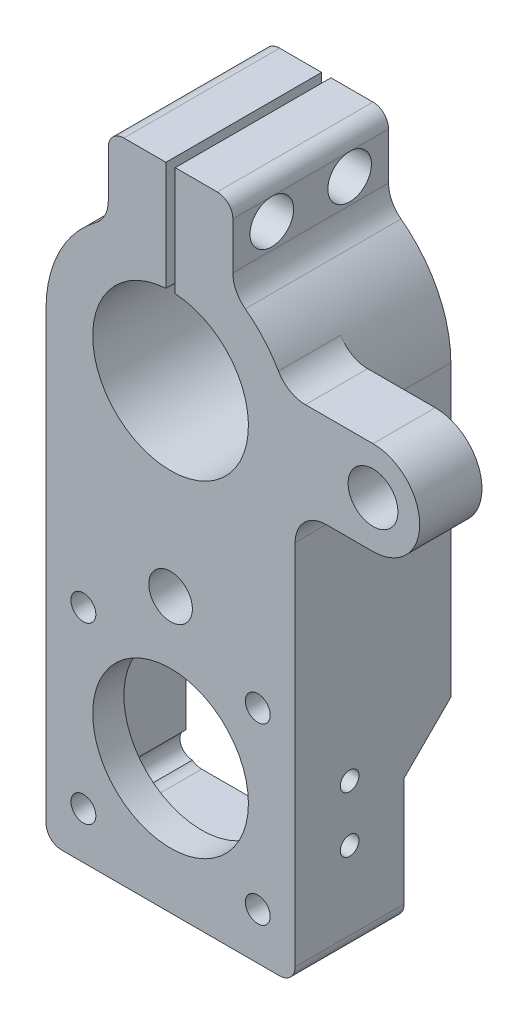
ISO-10303-21;
HEADER;
FILE_DESCRIPTION(('STEP AP214'),'2;1');
FILE_NAME('part.step','',(''),(''),'','','');
FILE_SCHEMA(('AUTOMOTIVE_DESIGN { 1 0 10303 214 1 1 1 1 }'));
ENDSEC;
DATA;
#1=APPLICATION_CONTEXT('core data for automotive mechanical design processes');
#2=APPLICATION_PROTOCOL_DEFINITION('international standard','automotive_design',2000,#1);
#3=PRODUCT_CONTEXT('',#1,'mechanical');
#4=PRODUCT('Part','Part','',(#3));
#5=PRODUCT_RELATED_PRODUCT_CATEGORY('part','',(#4));
#6=PRODUCT_DEFINITION_FORMATION('','',#4);
#7=PRODUCT_DEFINITION_CONTEXT('part definition',#1,'design');
#8=PRODUCT_DEFINITION('design','',#6,#7);
#9=PRODUCT_DEFINITION_SHAPE('','',#8);
#10=(LENGTH_UNIT() NAMED_UNIT(*) SI_UNIT(.MILLI.,.METRE.));
#11=(NAMED_UNIT(*) PLANE_ANGLE_UNIT() SI_UNIT($,.RADIAN.));
#12=(NAMED_UNIT(*) SI_UNIT($,.STERADIAN.) SOLID_ANGLE_UNIT());
#13=UNCERTAINTY_MEASURE_WITH_UNIT(LENGTH_MEASURE(1.E-05),#10,'distance_accuracy_value','');
#14=(GEOMETRIC_REPRESENTATION_CONTEXT(3) GLOBAL_UNCERTAINTY_ASSIGNED_CONTEXT((#13)) GLOBAL_UNIT_ASSIGNED_CONTEXT((#10,
#11,#12)) REPRESENTATION_CONTEXT('',''));
#15=CARTESIAN_POINT('',(0.,0.,0.));
#16=DIRECTION('',(0.,0.,1.));
#17=DIRECTION('',(1.,0.,0.));
#18=AXIS2_PLACEMENT_3D('',#15,#16,#17);
#19=CARTESIAN_POINT('',(0.,165.,20.));
#20=DIRECTION('',(0.,-1.,0.));
#21=DIRECTION('',(0.,0.,-1.));
#22=AXIS2_PLACEMENT_3D('',#19,#20,#21);
#23=PLANE('',#22);
#24=DIRECTION('',(-1.,0.,0.));
#25=VECTOR('',#24,1.);
#26=CARTESIAN_POINT('',(0.,165.,20.));
#27=LINE('',#26,#25);
#28=CARTESIAN_POINT('',(-1.5,165.,20.));
#29=VERTEX_POINT('',#28);
#30=CARTESIAN_POINT('',(-14.9999999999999,165.,20.));
#31=VERTEX_POINT('',#30);
#32=EDGE_CURVE('E331',#29,#31,#27,.T.);
#33=ORIENTED_EDGE('',*,*,#32,.F.);
#34=DIRECTION('',(0.,0.,1.));
#35=VECTOR('',#34,1.);
#36=CARTESIAN_POINT('',(-1.5,165.,40.6412685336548));
#37=LINE('',#36,#35);
#38=CARTESIAN_POINT('',(-1.5,165.,-30.));
#39=VERTEX_POINT('',#38);
#40=EDGE_CURVE('E318',#39,#29,#37,.T.);
#41=ORIENTED_EDGE('',*,*,#40,.F.);
#42=DIRECTION('',(1.,0.,0.));
#43=VECTOR('',#42,1.);
#44=CARTESIAN_POINT('',(15.,165.,-30.));
#45=LINE('',#44,#43);
#46=CARTESIAN_POINT('',(-14.9999999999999,165.,-30.));
#47=VERTEX_POINT('',#46);
#48=EDGE_CURVE('E330',#47,#39,#45,.T.);
#49=ORIENTED_EDGE('',*,*,#48,.F.);
#50=DIRECTION('',(0.,0.,-1.));
#51=VECTOR('',#50,1.);
#52=CARTESIAN_POINT('',(-14.9999999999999,165.,20.));
#53=LINE('',#52,#51);
#54=EDGE_CURVE('E456',#31,#47,#53,.T.);
#55=ORIENTED_EDGE('',*,*,#54,.F.);
#56=EDGE_LOOP('',(#33,#41,#49,#55));
#57=FACE_BOUND('',#56,.T.);
#58=ADVANCED_FACE('F36',(#57),#23,.F.);
#59=CARTESIAN_POINT('',(0.,105.,20.));
#60=DIRECTION('',(0.,0.,1.));
#61=DIRECTION('',(1.,0.,0.));
#62=AXIS2_PLACEMENT_3D('',#59,#60,#61);
#63=PLANE('',#62);
#64=DIRECTION('',(0.,-1.,0.));
#65=VECTOR('',#64,1.);
#66=CARTESIAN_POINT('',(-1.5,105.,20.));
#67=LINE('',#66,#65);
#68=CARTESIAN_POINT('',(-1.5,129.954959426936,20.));
#69=VERTEX_POINT('',#68);
#70=EDGE_CURVE('E721',#29,#69,#67,.T.);
#71=ORIENTED_EDGE('',*,*,#70,.F.);
#72=ORIENTED_EDGE('',*,*,#32,.T.);
#73=CARTESIAN_POINT('',(-15.,160.,20.));
#74=DIRECTION('',(0.,0.,1.));
#75=DIRECTION('',(-1.,0.,0.));
#76=AXIS2_PLACEMENT_3D('',#73,#74,#75);
#77=CIRCLE('',#76,5.);
#78=CARTESIAN_POINT('',(-20.,160.,20.));
#79=VERTEX_POINT('',#78);
#80=EDGE_CURVE('E427',#31,#79,#77,.T.);
#81=ORIENTED_EDGE('',*,*,#80,.T.);
#82=DIRECTION('',(0.,-1.,0.));
#83=VECTOR('',#82,1.);
#84=CARTESIAN_POINT('',(-20.,160.,20.));
#85=LINE('',#84,#83);
#86=CARTESIAN_POINT('',(-19.9999999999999,145.000000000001,20.));
#87=VERTEX_POINT('',#86);
#88=EDGE_CURVE('E429',#79,#87,#85,.T.);
#89=ORIENTED_EDGE('',*,*,#88,.T.);
#90=CARTESIAN_POINT('',(-29.9999999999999,145.000000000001,20.));
#91=DIRECTION('',(0.,0.,-1.));
#92=DIRECTION('',(-1.,0.,0.));
#93=AXIS2_PLACEMENT_3D('',#90,#91,#92);
#94=CIRCLE('',#93,10.);
#95=CARTESIAN_POINT('',(-24.,137.000000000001,20.));
#96=VERTEX_POINT('',#95);
#97=EDGE_CURVE('E431',#87,#96,#94,.T.);
#98=ORIENTED_EDGE('',*,*,#97,.T.);
#99=CARTESIAN_POINT('',(0.,105.,20.));
#100=DIRECTION('',(0.,0.,1.));
#101=DIRECTION('',(1.,0.,0.));
#102=AXIS2_PLACEMENT_3D('',#99,#100,#101);
#103=CIRCLE('',#102,40.0000000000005);
#104=CARTESIAN_POINT('',(-40.0000000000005,105.,20.));
#105=VERTEX_POINT('',#104);
#106=EDGE_CURVE('E433',#96,#105,#103,.T.);
#107=ORIENTED_EDGE('',*,*,#106,.T.);
#108=DIRECTION('',(0.,-1.,0.));
#109=VECTOR('',#108,1.);
#110=CARTESIAN_POINT('',(-40.,-43.,20.));
#111=LINE('',#110,#109);
#112=CARTESIAN_POINT('',(-40.,-38.,20.));
#113=VERTEX_POINT('',#112);
#114=EDGE_CURVE('E435',#105,#113,#111,.T.);
#115=ORIENTED_EDGE('',*,*,#114,.T.);
#116=CARTESIAN_POINT('',(-35.,-38.,20.));
#117=DIRECTION('',(0.,0.,1.));
#118=DIRECTION('',(1.,0.,0.));
#119=AXIS2_PLACEMENT_3D('',#116,#117,#118);
#120=CIRCLE('',#119,5.);
#121=CARTESIAN_POINT('',(-35.,-43.,20.));
#122=VERTEX_POINT('',#121);
#123=EDGE_CURVE('E498',#113,#122,#120,.T.);
#124=ORIENTED_EDGE('',*,*,#123,.T.);
#125=DIRECTION('',(1.,0.,0.));
#126=VECTOR('',#125,1.);
#127=CARTESIAN_POINT('',(0.,-43.,20.));
#128=LINE('',#127,#126);
#129=CARTESIAN_POINT('',(35.,-43.,20.));
#130=VERTEX_POINT('',#129);
#131=EDGE_CURVE('E400',#122,#130,#128,.T.);
#132=ORIENTED_EDGE('',*,*,#131,.T.);
#133=CARTESIAN_POINT('',(35.,-38.,20.));
#134=DIRECTION('',(0.,0.,1.));
#135=DIRECTION('',(1.,0.,0.));
#136=AXIS2_PLACEMENT_3D('',#133,#134,#135);
#137=CIRCLE('',#136,5.);
#138=CARTESIAN_POINT('',(40.,-38.,20.));
#139=VERTEX_POINT('',#138);
#140=EDGE_CURVE('E496',#130,#139,#137,.T.);
#141=ORIENTED_EDGE('',*,*,#140,.T.);
#142=DIRECTION('',(0.,1.,0.));
#143=VECTOR('',#142,1.);
#144=CARTESIAN_POINT('',(40.,-43.,20.));
#145=LINE('',#144,#143);
#146=CARTESIAN_POINT('',(39.9999999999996,79.9999999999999,20.));
#147=VERTEX_POINT('',#146);
#148=EDGE_CURVE('E403',#139,#147,#145,.T.);
#149=ORIENTED_EDGE('',*,*,#148,.T.);
#150=CARTESIAN_POINT('',(49.9999999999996,80.,20.));
#151=DIRECTION('',(0.,0.,-1.));
#152=DIRECTION('',(1.,0.,0.));
#153=AXIS2_PLACEMENT_3D('',#150,#151,#152);
#154=CIRCLE('',#153,10.);
#155=CARTESIAN_POINT('',(49.9999999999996,90.,20.));
#156=VERTEX_POINT('',#155);
#157=EDGE_CURVE('E406',#147,#156,#154,.T.);
#158=ORIENTED_EDGE('',*,*,#157,.T.);
#159=DIRECTION('',(1.,0.,0.));
#160=VECTOR('',#159,1.);
#161=CARTESIAN_POINT('',(65.,90.,20.));
#162=LINE('',#161,#160);
#163=CARTESIAN_POINT('',(65.,90.,20.));
#164=VERTEX_POINT('',#163);
#165=EDGE_CURVE('E408',#156,#164,#162,.T.);
#166=ORIENTED_EDGE('',*,*,#165,.T.);
#167=CARTESIAN_POINT('',(65.,105.,20.));
#168=DIRECTION('',(0.,0.,1.));
#169=DIRECTION('',(1.,0.,0.));
#170=AXIS2_PLACEMENT_3D('',#167,#168,#169);
#171=CIRCLE('',#170,15.);
#172=CARTESIAN_POINT('',(65.,120.,20.));
#173=VERTEX_POINT('',#172);
#174=EDGE_CURVE('E410',#164,#173,#171,.T.);
#175=ORIENTED_EDGE('',*,*,#174,.T.);
#176=DIRECTION('',(-1.,0.,0.));
#177=VECTOR('',#176,1.);
#178=CARTESIAN_POINT('',(65.,120.,20.));
#179=LINE('',#178,#177);
#180=CARTESIAN_POINT('',(43.3012701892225,120.,20.));
#181=VERTEX_POINT('',#180);
#182=EDGE_CURVE('E412',#173,#181,#179,.T.);
#183=ORIENTED_EDGE('',*,*,#182,.T.);
#184=CARTESIAN_POINT('',(43.3012701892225,130.,20.));
#185=DIRECTION('',(0.,0.,-1.));
#186=DIRECTION('',(1.,0.,0.));
#187=AXIS2_PLACEMENT_3D('',#184,#185,#186);
#188=CIRCLE('',#187,10.);
#189=CARTESIAN_POINT('',(34.6410161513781,125.,20.));
#190=VERTEX_POINT('',#189);
#191=EDGE_CURVE('E414',#181,#190,#188,.T.);
#192=ORIENTED_EDGE('',*,*,#191,.T.);
#193=CARTESIAN_POINT('',(0.,105.,20.));
#194=DIRECTION('',(0.,0.,1.));
#195=DIRECTION('',(1.,0.,0.));
#196=AXIS2_PLACEMENT_3D('',#193,#194,#195);
#197=CIRCLE('',#196,40.0000000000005);
#198=CARTESIAN_POINT('',(24.0000000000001,137.000000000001,20.));
#199=VERTEX_POINT('',#198);
#200=EDGE_CURVE('E416',#190,#199,#197,.T.);
#201=ORIENTED_EDGE('',*,*,#200,.T.);
#202=CARTESIAN_POINT('',(30.0000000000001,145.000000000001,20.));
#203=DIRECTION('',(0.,0.,-1.));
#204=DIRECTION('',(1.,0.,0.));
#205=AXIS2_PLACEMENT_3D('',#202,#203,#204);
#206=CIRCLE('',#205,10.);
#207=CARTESIAN_POINT('',(20.0000000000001,145.000000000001,20.));
#208=VERTEX_POINT('',#207);
#209=EDGE_CURVE('E418',#199,#208,#206,.T.);
#210=ORIENTED_EDGE('',*,*,#209,.T.);
#211=DIRECTION('',(0.,1.,0.));
#212=VECTOR('',#211,1.);
#213=CARTESIAN_POINT('',(20.,160.,20.));
#214=LINE('',#213,#212);
#215=CARTESIAN_POINT('',(20.,160.,20.));
#216=VERTEX_POINT('',#215);
#217=EDGE_CURVE('E420',#208,#216,#214,.T.);
#218=ORIENTED_EDGE('',*,*,#217,.T.);
#219=CARTESIAN_POINT('',(15.,160.,20.));
#220=DIRECTION('',(0.,0.,1.));
#221=DIRECTION('',(-1.,0.,0.));
#222=AXIS2_PLACEMENT_3D('',#219,#220,#221);
#223=CIRCLE('',#222,5.);
#224=CARTESIAN_POINT('',(15.,165.,20.));
#225=VERTEX_POINT('',#224);
#226=EDGE_CURVE('E422',#216,#225,#223,.T.);
#227=ORIENTED_EDGE('',*,*,#226,.T.);
#228=CARTESIAN_POINT('',(1.5,165.,20.));
#229=VERTEX_POINT('',#228);
#230=EDGE_CURVE('E424',#225,#229,#27,.T.);
#231=ORIENTED_EDGE('',*,*,#230,.T.);
#232=DIRECTION('',(0.,1.,0.));
#233=VECTOR('',#232,1.);
#234=CARTESIAN_POINT('',(1.5,105.,20.));
#235=LINE('',#234,#233);
#236=CARTESIAN_POINT('',(1.5,129.954959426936,20.));
#237=VERTEX_POINT('',#236);
#238=EDGE_CURVE('E715',#237,#229,#235,.T.);
#239=ORIENTED_EDGE('',*,*,#238,.F.);
#240=CARTESIAN_POINT('',(0.,105.,20.));
#241=DIRECTION('',(0.,0.,1.));
#242=DIRECTION('',(1.,0.,0.));
#243=AXIS2_PLACEMENT_3D('',#240,#241,#242);
#244=CIRCLE('',#243,25.);
#245=EDGE_CURVE('E391',#69,#237,#244,.T.);
#246=ORIENTED_EDGE('',*,*,#245,.F.);
#247=EDGE_LOOP('',(#71,#72,#81,#89,#98,#107,#115,#124,#132,#141,#149,#158,#166,#175,#183,#192,
#201,#210,#218,#227,#231,#239,#246));
#248=FACE_BOUND('',#247,.T.);
#249=CARTESIAN_POINT('',(-28.,28.,20.));
#250=DIRECTION('',(0.,0.,1.));
#251=DIRECTION('',(-1.,0.,0.));
#252=AXIS2_PLACEMENT_3D('',#249,#250,#251);
#253=CIRCLE('',#252,4.00000000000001);
#254=CARTESIAN_POINT('',(-32.,28.,20.));
#255=VERTEX_POINT('',#254);
#256=EDGE_CURVE('E375',#255,#255,#253,.T.);
#257=ORIENTED_EDGE('',*,*,#256,.F.);
#258=EDGE_LOOP('',(#257));
#259=FACE_BOUND('',#258,.T.);
#260=CARTESIAN_POINT('',(28.,-28.,20.));
#261=DIRECTION('',(0.,0.,1.));
#262=DIRECTION('',(-1.,0.,0.));
#263=AXIS2_PLACEMENT_3D('',#260,#261,#262);
#264=CIRCLE('',#263,4.);
#265=CARTESIAN_POINT('',(24.,-28.,20.));
#266=VERTEX_POINT('',#265);
#267=EDGE_CURVE('E381',#266,#266,#264,.T.);
#268=ORIENTED_EDGE('',*,*,#267,.F.);
#269=EDGE_LOOP('',(#268));
#270=FACE_BOUND('',#269,.T.);
#271=CARTESIAN_POINT('',(65.,105.,20.));
#272=DIRECTION('',(0.,0.,1.));
#273=DIRECTION('',(1.,0.,0.));
#274=AXIS2_PLACEMENT_3D('',#271,#272,#273);
#275=CIRCLE('',#274,8.00000000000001);
#276=CARTESIAN_POINT('',(73.,105.,20.));
#277=VERTEX_POINT('',#276);
#278=EDGE_CURVE('E388',#277,#277,#275,.T.);
#279=ORIENTED_EDGE('',*,*,#278,.F.);
#280=EDGE_LOOP('',(#279));
#281=FACE_BOUND('',#280,.T.);
#282=CARTESIAN_POINT('',(0.,0.,20.));
#283=DIRECTION('',(0.,0.,1.));
#284=DIRECTION('',(1.,0.,0.));
#285=AXIS2_PLACEMENT_3D('',#282,#283,#284);
#286=CIRCLE('',#285,25.);
#287=CARTESIAN_POINT('',(25.,0.,20.));
#288=VERTEX_POINT('',#287);
#289=EDGE_CURVE('E396',#288,#288,#286,.T.);
#290=ORIENTED_EDGE('',*,*,#289,.F.);
#291=EDGE_LOOP('',(#290));
#292=FACE_BOUND('',#291,.T.);
#293=CARTESIAN_POINT('',(28.,28.,20.));
#294=DIRECTION('',(0.,0.,1.));
#295=DIRECTION('',(1.,0.,0.));
#296=AXIS2_PLACEMENT_3D('',#293,#294,#295);
#297=CIRCLE('',#296,4.);
#298=CARTESIAN_POINT('',(32.,28.,20.));
#299=VERTEX_POINT('',#298);
#300=EDGE_CURVE('E384',#299,#299,#297,.T.);
#301=ORIENTED_EDGE('',*,*,#300,.F.);
#302=EDGE_LOOP('',(#301));
#303=FACE_BOUND('',#302,.T.);
#304=CARTESIAN_POINT('',(-28.,-28.,20.));
#305=DIRECTION('',(0.,0.,1.));
#306=DIRECTION('',(1.,0.,0.));
#307=AXIS2_PLACEMENT_3D('',#304,#305,#306);
#308=CIRCLE('',#307,3.99999999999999);
#309=CARTESIAN_POINT('',(-24.,-28.,20.));
#310=VERTEX_POINT('',#309);
#311=EDGE_CURVE('E378',#310,#310,#308,.T.);
#312=ORIENTED_EDGE('',*,*,#311,.F.);
#313=EDGE_LOOP('',(#312));
#314=FACE_BOUND('',#313,.T.);
#315=CARTESIAN_POINT('',(0.,45.,20.));
#316=DIRECTION('',(0.,0.,1.));
#317=DIRECTION('',(1.,0.,0.));
#318=AXIS2_PLACEMENT_3D('',#315,#316,#317);
#319=CIRCLE('',#318,7.);
#320=CARTESIAN_POINT('',(7.,45.,20.));
#321=VERTEX_POINT('',#320);
#322=EDGE_CURVE('E372',#321,#321,#319,.T.);
#323=ORIENTED_EDGE('',*,*,#322,.F.);
#324=EDGE_LOOP('',(#323));
#325=FACE_BOUND('',#324,.T.);
#326=ADVANCED_FACE('F667',(#248,#259,#270,#281,#292,#303,#314,#325),#63,.T.);
#327=CARTESIAN_POINT('',(0.,105.,0.));
#328=DIRECTION('',(0.,0.,1.));
#329=DIRECTION('',(1.,0.,0.));
#330=AXIS2_PLACEMENT_3D('',#327,#328,#329);
#331=PLANE('',#330);
#332=DIRECTION('',(0.,-1.,0.));
#333=VECTOR('',#332,1.);
#334=CARTESIAN_POINT('',(40.,-38.,0.));
#335=LINE('',#334,#333);
#336=CARTESIAN_POINT('',(39.9999999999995,105.,0.));
#337=VERTEX_POINT('',#336);
#338=CARTESIAN_POINT('',(39.9999999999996,79.9999999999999,0.));
#339=VERTEX_POINT('',#338);
#340=EDGE_CURVE('E365',#337,#339,#335,.T.);
#341=ORIENTED_EDGE('',*,*,#340,.F.);
#342=CARTESIAN_POINT('',(0.,105.,0.));
#343=DIRECTION('',(0.,0.,-1.));
#344=DIRECTION('',(-1.,0.,0.));
#345=AXIS2_PLACEMENT_3D('',#342,#343,#344);
#346=CIRCLE('',#345,40.);
#347=CARTESIAN_POINT('',(34.6410161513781,125.,0.));
#348=VERTEX_POINT('',#347);
#349=EDGE_CURVE('E360',#348,#337,#346,.T.);
#350=ORIENTED_EDGE('',*,*,#349,.F.);
#351=CARTESIAN_POINT('',(43.3012701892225,130.,0.));
#352=DIRECTION('',(0.,0.,-1.));
#353=DIRECTION('',(1.,0.,0.));
#354=AXIS2_PLACEMENT_3D('',#351,#352,#353);
#355=CIRCLE('',#354,10.);
#356=CARTESIAN_POINT('',(43.3012701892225,120.,0.));
#357=VERTEX_POINT('',#356);
#358=EDGE_CURVE('E404',#357,#348,#355,.T.);
#359=ORIENTED_EDGE('',*,*,#358,.F.);
#360=DIRECTION('',(-1.,0.,0.));
#361=VECTOR('',#360,1.);
#362=CARTESIAN_POINT('',(65.,120.,0.));
#363=LINE('',#362,#361);
#364=CARTESIAN_POINT('',(65.,120.,0.));
#365=VERTEX_POINT('',#364);
#366=EDGE_CURVE('E444',#365,#357,#363,.T.);
#367=ORIENTED_EDGE('',*,*,#366,.F.);
#368=CARTESIAN_POINT('',(65.,105.,0.));
#369=DIRECTION('',(0.,0.,1.));
#370=DIRECTION('',(1.,0.,0.));
#371=AXIS2_PLACEMENT_3D('',#368,#369,#370);
#372=CIRCLE('',#371,15.);
#373=CARTESIAN_POINT('',(65.,90.,0.));
#374=VERTEX_POINT('',#373);
#375=EDGE_CURVE('E442',#374,#365,#372,.T.);
#376=ORIENTED_EDGE('',*,*,#375,.F.);
#377=DIRECTION('',(1.,0.,0.));
#378=VECTOR('',#377,1.);
#379=CARTESIAN_POINT('',(65.,90.,0.));
#380=LINE('',#379,#378);
#381=CARTESIAN_POINT('',(49.9999999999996,90.,0.));
#382=VERTEX_POINT('',#381);
#383=EDGE_CURVE('E440',#382,#374,#380,.T.);
#384=ORIENTED_EDGE('',*,*,#383,.F.);
#385=CARTESIAN_POINT('',(49.9999999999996,80.,0.));
#386=DIRECTION('',(0.,0.,-1.));
#387=DIRECTION('',(1.,0.,0.));
#388=AXIS2_PLACEMENT_3D('',#385,#386,#387);
#389=CIRCLE('',#388,10.);
#390=EDGE_CURVE('E399',#339,#382,#389,.T.);
#391=ORIENTED_EDGE('',*,*,#390,.F.);
#392=EDGE_LOOP('',(#341,#350,#359,#367,#376,#384,#391));
#393=FACE_BOUND('',#392,.T.);
#394=CARTESIAN_POINT('',(65.,105.,0.));
#395=DIRECTION('',(0.,0.,1.));
#396=DIRECTION('',(1.,0.,0.));
#397=AXIS2_PLACEMENT_3D('',#394,#395,#396);
#398=CIRCLE('',#397,8.00000000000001);
#399=CARTESIAN_POINT('',(73.,105.,0.));
#400=VERTEX_POINT('',#399);
#401=EDGE_CURVE('E387',#400,#400,#398,.T.);
#402=ORIENTED_EDGE('',*,*,#401,.T.);
#403=EDGE_LOOP('',(#402));
#404=FACE_BOUND('',#403,.T.);
#405=ADVANCED_FACE('F670',(#393,#404),#331,.F.);
#406=CARTESIAN_POINT('',(0.,-43.,20.));
#407=DIRECTION('',(0.,1.,0.));
#408=DIRECTION('',(0.,0.,1.));
#409=AXIS2_PLACEMENT_3D('',#406,#407,#408);
#410=PLANE('',#409);
#411=DIRECTION('',(0.,0.,-1.));
#412=VECTOR('',#411,1.);
#413=CARTESIAN_POINT('',(-35.,-43.,20.));
#414=LINE('',#413,#412);
#415=CARTESIAN_POINT('',(-35.,-43.0000000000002,-15.));
#416=VERTEX_POINT('',#415);
#417=EDGE_CURVE('E491',#122,#416,#414,.T.);
#418=ORIENTED_EDGE('',*,*,#417,.T.);
#419=DIRECTION('',(1.,0.,0.));
#420=VECTOR('',#419,1.);
#421=CARTESIAN_POINT('',(-40.,-43.0000000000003,-15.));
#422=LINE('',#421,#420);
#423=CARTESIAN_POINT('',(35.,-43.,-15.));
#424=VERTEX_POINT('',#423);
#425=EDGE_CURVE('E734',#416,#424,#422,.T.);
#426=ORIENTED_EDGE('',*,*,#425,.T.);
#427=DIRECTION('',(0.,0.,-1.));
#428=VECTOR('',#427,1.);
#429=CARTESIAN_POINT('',(35.,-43.,20.));
#430=LINE('',#429,#428);
#431=EDGE_CURVE('E489',#424,#130,#430,.F.);
#432=ORIENTED_EDGE('',*,*,#431,.T.);
#433=ORIENTED_EDGE('',*,*,#131,.F.);
#434=EDGE_LOOP('',(#418,#426,#432,#433));
#435=FACE_BOUND('',#434,.T.);
#436=ADVANCED_FACE('F673',(#435),#410,.F.);
#437=CARTESIAN_POINT('',(40.,-43.,20.));
#438=DIRECTION('',(-1.,0.,0.));
#439=DIRECTION('',(0.,-1.,0.));
#440=AXIS2_PLACEMENT_3D('',#437,#438,#439);
#441=PLANE('',#440);
#442=CARTESIAN_POINT('',(39.9999999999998,5.00000000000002,2.5));
#443=DIRECTION('',(1.,0.,0.));
#444=DIRECTION('',(0.,1.,0.));
#445=AXIS2_PLACEMENT_3D('',#442,#443,#444);
#446=CIRCLE('',#445,3.);
#447=CARTESIAN_POINT('',(39.9999999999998,8.00000000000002,2.5));
#448=VERTEX_POINT('',#447);
#449=EDGE_CURVE('E1000',#448,#448,#446,.T.);
#450=ORIENTED_EDGE('',*,*,#449,.F.);
#451=EDGE_LOOP('',(#450));
#452=FACE_BOUND('',#451,.T.);
#453=CARTESIAN_POINT('',(39.9999999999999,-13.,2.5));
#454=DIRECTION('',(1.,0.,0.));
#455=DIRECTION('',(0.,1.,0.));
#456=AXIS2_PLACEMENT_3D('',#453,#454,#455);
#457=CIRCLE('',#456,3.);
#458=CARTESIAN_POINT('',(39.9999999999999,-9.99999999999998,2.5));
#459=VERTEX_POINT('',#458);
#460=EDGE_CURVE('E990',#459,#459,#457,.T.);
#461=ORIENTED_EDGE('',*,*,#460,.F.);
#462=EDGE_LOOP('',(#461));
#463=FACE_BOUND('',#462,.T.);
#464=DIRECTION('',(0.,0.,-1.));
#465=VECTOR('',#464,1.);
#466=CARTESIAN_POINT('',(39.9999999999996,79.9999999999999,20.));
#467=LINE('',#466,#465);
#468=CARTESIAN_POINT('',(39.9999999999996,79.9999999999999,2.5));
#469=VERTEX_POINT('',#468);
#470=EDGE_CURVE('E485',#469,#339,#467,.T.);
#471=ORIENTED_EDGE('',*,*,#470,.F.);
#472=CARTESIAN_POINT('',(39.9999999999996,77.,2.5));
#473=DIRECTION('',(1.,0.,0.));
#474=DIRECTION('',(0.,1.,0.));
#475=AXIS2_PLACEMENT_3D('',#472,#473,#474);
#476=CIRCLE('',#475,3.);
#477=EDGE_CURVE('E55',#469,#469,#476,.T.);
#478=ORIENTED_EDGE('',*,*,#477,.F.);
#479=EDGE_CURVE('E486',#147,#469,#467,.T.);
#480=ORIENTED_EDGE('',*,*,#479,.F.);
#481=ORIENTED_EDGE('',*,*,#148,.F.);
#482=DIRECTION('',(0.,0.,-1.));
#483=VECTOR('',#482,1.);
#484=CARTESIAN_POINT('',(40.,-38.,20.));
#485=LINE('',#484,#483);
#486=CARTESIAN_POINT('',(40.,-38.,-15.));
#487=VERTEX_POINT('',#486);
#488=EDGE_CURVE('E364',#139,#487,#485,.T.);
#489=ORIENTED_EDGE('',*,*,#488,.T.);
#490=DIRECTION('',(0.,-1.,0.));
#491=VECTOR('',#490,1.);
#492=CARTESIAN_POINT('',(39.9999999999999,-2.99999999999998,-15.));
#493=LINE('',#492,#491);
#494=CARTESIAN_POINT('',(39.9999999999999,-2.99999999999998,-15.));
#495=VERTEX_POINT('',#494);
#496=EDGE_CURVE('E727',#495,#487,#493,.T.);
#497=ORIENTED_EDGE('',*,*,#496,.F.);
#498=DIRECTION('',(0.,-0.707106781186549,0.707106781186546));
#499=VECTOR('',#498,1.);
#500=CARTESIAN_POINT('',(39.9999999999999,-2.99999999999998,-15.));
#501=LINE('',#500,#499);
#502=CARTESIAN_POINT('',(39.9999999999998,12.0000000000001,-30.));
#503=VERTEX_POINT('',#502);
#504=EDGE_CURVE('E723',#503,#495,#501,.T.);
#505=ORIENTED_EDGE('',*,*,#504,.F.);
#506=DIRECTION('',(0.,-1.,0.));
#507=VECTOR('',#506,1.);
#508=CARTESIAN_POINT('',(40.,-38.,-30.));
#509=LINE('',#508,#507);
#510=CARTESIAN_POINT('',(39.9999999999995,105.,-30.));
#511=VERTEX_POINT('',#510);
#512=EDGE_CURVE('E356',#511,#503,#509,.T.);
#513=ORIENTED_EDGE('',*,*,#512,.F.);
#514=DIRECTION('',(0.,0.,1.));
#515=VECTOR('',#514,1.);
#516=CARTESIAN_POINT('',(39.9999999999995,105.,-30.));
#517=LINE('',#516,#515);
#518=EDGE_CURVE('E359',#511,#337,#517,.T.);
#519=ORIENTED_EDGE('',*,*,#518,.T.);
#520=ORIENTED_EDGE('',*,*,#340,.T.);
#521=EDGE_LOOP('',(#471,#478,#480,#481,#489,#497,#505,#513,#519,#520));
#522=FACE_BOUND('',#521,.T.);
#523=ADVANCED_FACE('F888',(#452,#463,#522),#441,.F.);
#524=CARTESIAN_POINT('',(49.9999999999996,80.,20.));
#525=DIRECTION('',(0.,0.,-1.));
#526=DIRECTION('',(-1.,0.,0.));
#527=AXIS2_PLACEMENT_3D('',#524,#525,#526);
#528=CYLINDRICAL_SURFACE('',#527,10.);
#529=ORIENTED_EDGE('',*,*,#390,.T.);
#530=DIRECTION('',(0.,0.,-1.));
#531=VECTOR('',#530,1.);
#532=CARTESIAN_POINT('',(49.9999999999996,90.,20.));
#533=LINE('',#532,#531);
#534=EDGE_CURVE('E482',#156,#382,#533,.T.);
#535=ORIENTED_EDGE('',*,*,#534,.F.);
#536=ORIENTED_EDGE('',*,*,#157,.F.);
#537=ORIENTED_EDGE('',*,*,#479,.T.);
#538=ORIENTED_EDGE('',*,*,#470,.T.);
#539=EDGE_LOOP('',(#529,#535,#536,#537,#538));
#540=FACE_BOUND('',#539,.T.);
#541=ADVANCED_FACE('F1286',(#540),#528,.F.);
#542=CARTESIAN_POINT('',(65.,90.,20.));
#543=DIRECTION('',(0.,1.,0.));
#544=DIRECTION('',(0.,0.,1.));
#545=AXIS2_PLACEMENT_3D('',#542,#543,#544);
#546=PLANE('',#545);
#547=ORIENTED_EDGE('',*,*,#383,.T.);
#548=DIRECTION('',(0.,0.,-1.));
#549=VECTOR('',#548,1.);
#550=CARTESIAN_POINT('',(65.,90.,20.));
#551=LINE('',#550,#549);
#552=EDGE_CURVE('E479',#164,#374,#551,.T.);
#553=ORIENTED_EDGE('',*,*,#552,.F.);
#554=ORIENTED_EDGE('',*,*,#165,.F.);
#555=ORIENTED_EDGE('',*,*,#534,.T.);
#556=EDGE_LOOP('',(#547,#553,#554,#555));
#557=FACE_BOUND('',#556,.T.);
#558=ADVANCED_FACE('F1292',(#557),#546,.F.);
#559=CARTESIAN_POINT('',(65.,105.,20.));
#560=DIRECTION('',(0.,0.,-1.));
#561=DIRECTION('',(-1.,0.,0.));
#562=AXIS2_PLACEMENT_3D('',#559,#560,#561);
#563=CYLINDRICAL_SURFACE('',#562,15.);
#564=ORIENTED_EDGE('',*,*,#375,.T.);
#565=DIRECTION('',(0.,0.,-1.));
#566=VECTOR('',#565,1.);
#567=CARTESIAN_POINT('',(65.,120.,20.));
#568=LINE('',#567,#566);
#569=EDGE_CURVE('E476',#173,#365,#568,.T.);
#570=ORIENTED_EDGE('',*,*,#569,.F.);
#571=ORIENTED_EDGE('',*,*,#174,.F.);
#572=ORIENTED_EDGE('',*,*,#552,.T.);
#573=EDGE_LOOP('',(#564,#570,#571,#572));
#574=FACE_BOUND('',#573,.T.);
#575=ADVANCED_FACE('F1300',(#574),#563,.T.);
#576=CARTESIAN_POINT('',(65.,120.,20.));
#577=DIRECTION('',(0.,-1.,0.));
#578=DIRECTION('',(0.,0.,-1.));
#579=AXIS2_PLACEMENT_3D('',#576,#577,#578);
#580=PLANE('',#579);
#581=ORIENTED_EDGE('',*,*,#366,.T.);
#582=DIRECTION('',(0.,0.,-1.));
#583=VECTOR('',#582,1.);
#584=CARTESIAN_POINT('',(43.3012701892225,120.,20.));
#585=LINE('',#584,#583);
#586=EDGE_CURVE('E473',#181,#357,#585,.T.);
#587=ORIENTED_EDGE('',*,*,#586,.F.);
#588=ORIENTED_EDGE('',*,*,#182,.F.);
#589=ORIENTED_EDGE('',*,*,#569,.T.);
#590=EDGE_LOOP('',(#581,#587,#588,#589));
#591=FACE_BOUND('',#590,.T.);
#592=ADVANCED_FACE('F1260',(#591),#580,.F.);
#593=CARTESIAN_POINT('',(43.3012701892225,130.,20.));
#594=DIRECTION('',(0.,0.,-1.));
#595=DIRECTION('',(-1.,0.,0.));
#596=AXIS2_PLACEMENT_3D('',#593,#594,#595);
#597=CYLINDRICAL_SURFACE('',#596,10.);
#598=ORIENTED_EDGE('',*,*,#358,.T.);
#599=DIRECTION('',(0.,0.,-1.));
#600=VECTOR('',#599,1.);
#601=CARTESIAN_POINT('',(34.6410161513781,125.,20.));
#602=LINE('',#601,#600);
#603=EDGE_CURVE('E470',#190,#348,#602,.T.);
#604=ORIENTED_EDGE('',*,*,#603,.F.);
#605=ORIENTED_EDGE('',*,*,#191,.F.);
#606=ORIENTED_EDGE('',*,*,#586,.T.);
#607=EDGE_LOOP('',(#598,#604,#605,#606));
#608=FACE_BOUND('',#607,.T.);
#609=ADVANCED_FACE('F1250',(#608),#597,.F.);
#610=CARTESIAN_POINT('',(0.,105.,20.));
#611=DIRECTION('',(0.,0.,-1.));
#612=DIRECTION('',(-1.,0.,0.));
#613=AXIS2_PLACEMENT_3D('',#610,#611,#612);
#614=CYLINDRICAL_SURFACE('',#613,40.0000000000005);
#615=ORIENTED_EDGE('',*,*,#603,.T.);
#616=ORIENTED_EDGE('',*,*,#349,.T.);
#617=ORIENTED_EDGE('',*,*,#518,.F.);
#618=CARTESIAN_POINT('',(0.,105.,-30.));
#619=DIRECTION('',(0.,0.,-1.));
#620=DIRECTION('',(-1.,0.,0.));
#621=AXIS2_PLACEMENT_3D('',#618,#619,#620);
#622=CIRCLE('',#621,40.);
#623=CARTESIAN_POINT('',(23.9999999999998,137.,-30.));
#624=VERTEX_POINT('',#623);
#625=EDGE_CURVE('E354',#624,#511,#622,.T.);
#626=ORIENTED_EDGE('',*,*,#625,.F.);
#627=DIRECTION('',(0.,0.,-1.));
#628=VECTOR('',#627,1.);
#629=CARTESIAN_POINT('',(24.0000000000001,137.000000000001,20.));
#630=LINE('',#629,#628);
#631=EDGE_CURVE('E468',#199,#624,#630,.T.);
#632=ORIENTED_EDGE('',*,*,#631,.F.);
#633=ORIENTED_EDGE('',*,*,#200,.F.);
#634=EDGE_LOOP('',(#615,#616,#617,#626,#632,#633));
#635=FACE_BOUND('',#634,.T.);
#636=ADVANCED_FACE('F880',(#635),#614,.T.);
#637=CARTESIAN_POINT('',(30.0000000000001,145.000000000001,20.));
#638=DIRECTION('',(0.,0.,-1.));
#639=DIRECTION('',(-1.,0.,0.));
#640=AXIS2_PLACEMENT_3D('',#637,#638,#639);
#641=CYLINDRICAL_SURFACE('',#640,10.);
#642=ORIENTED_EDGE('',*,*,#631,.T.);
#643=CARTESIAN_POINT('',(30.0000000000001,145.000000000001,-30.));
#644=DIRECTION('',(0.,0.,1.));
#645=DIRECTION('',(-1.,0.,0.));
#646=AXIS2_PLACEMENT_3D('',#643,#644,#645);
#647=CIRCLE('',#646,10.);
#648=CARTESIAN_POINT('',(20.0000000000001,145.000000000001,-30.));
#649=VERTEX_POINT('',#648);
#650=EDGE_CURVE('E351',#649,#624,#647,.T.);
#651=ORIENTED_EDGE('',*,*,#650,.F.);
#652=DIRECTION('',(0.,0.,-1.));
#653=VECTOR('',#652,1.);
#654=CARTESIAN_POINT('',(20.0000000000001,145.000000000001,20.));
#655=LINE('',#654,#653);
#656=EDGE_CURVE('E465',#208,#649,#655,.T.);
#657=ORIENTED_EDGE('',*,*,#656,.F.);
#658=ORIENTED_EDGE('',*,*,#209,.F.);
#659=EDGE_LOOP('',(#642,#651,#657,#658));
#660=FACE_BOUND('',#659,.T.);
#661=ADVANCED_FACE('F875',(#660),#641,.F.);
#662=CARTESIAN_POINT('',(20.,160.,20.));
#663=DIRECTION('',(-1.,0.,0.));
#664=DIRECTION('',(0.,-1.,0.));
#665=AXIS2_PLACEMENT_3D('',#662,#663,#664);
#666=PLANE('',#665);
#667=DIRECTION('',(0.,0.,-1.));
#668=VECTOR('',#667,1.);
#669=CARTESIAN_POINT('',(20.,160.,20.));
#670=LINE('',#669,#668);
#671=CARTESIAN_POINT('',(20.,160.,-17.5));
#672=VERTEX_POINT('',#671);
#673=CARTESIAN_POINT('',(20.,160.,-30.));
#674=VERTEX_POINT('',#673);
#675=EDGE_CURVE('E461',#672,#674,#670,.T.);
#676=ORIENTED_EDGE('',*,*,#675,.F.);
#677=CARTESIAN_POINT('',(20.,153.,-17.5));
#678=DIRECTION('',(1.,0.,0.));
#679=DIRECTION('',(0.,1.,0.));
#680=AXIS2_PLACEMENT_3D('',#677,#678,#679);
#681=CIRCLE('',#680,7.);
#682=EDGE_CURVE('E60',#672,#672,#681,.T.);
#683=ORIENTED_EDGE('',*,*,#682,.F.);
#684=CARTESIAN_POINT('',(20.,160.,7.5));
#685=VERTEX_POINT('',#684);
#686=EDGE_CURVE('E466',#685,#672,#670,.T.);
#687=ORIENTED_EDGE('',*,*,#686,.F.);
#688=CARTESIAN_POINT('',(20.,153.,7.5));
#689=DIRECTION('',(1.,0.,0.));
#690=DIRECTION('',(0.,1.,0.));
#691=AXIS2_PLACEMENT_3D('',#688,#689,#690);
#692=CIRCLE('',#691,7.00000000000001);
#693=EDGE_CURVE('E964',#685,#685,#692,.T.);
#694=ORIENTED_EDGE('',*,*,#693,.F.);
#695=EDGE_CURVE('E462',#216,#685,#670,.T.);
#696=ORIENTED_EDGE('',*,*,#695,.F.);
#697=ORIENTED_EDGE('',*,*,#217,.F.);
#698=ORIENTED_EDGE('',*,*,#656,.T.);
#699=DIRECTION('',(0.,-1.,0.));
#700=VECTOR('',#699,1.);
#701=CARTESIAN_POINT('',(20.0000000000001,145.000000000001,-30.));
#702=LINE('',#701,#700);
#703=EDGE_CURVE('E344',#674,#649,#702,.T.);
#704=ORIENTED_EDGE('',*,*,#703,.F.);
#705=EDGE_LOOP('',(#676,#683,#687,#694,#696,#697,#698,#704));
#706=FACE_BOUND('',#705,.T.);
#707=ADVANCED_FACE('F700',(#706),#666,.F.);
#708=CARTESIAN_POINT('',(15.,160.,20.));
#709=DIRECTION('',(0.,0.,-1.));
#710=DIRECTION('',(-1.,0.,0.));
#711=AXIS2_PLACEMENT_3D('',#708,#709,#710);
#712=CYLINDRICAL_SURFACE('',#711,5.);
#713=ORIENTED_EDGE('',*,*,#695,.T.);
#714=ORIENTED_EDGE('',*,*,#686,.T.);
#715=ORIENTED_EDGE('',*,*,#675,.T.);
#716=CARTESIAN_POINT('',(15.,160.,-30.));
#717=DIRECTION('',(0.,0.,-1.));
#718=DIRECTION('',(-1.,0.,0.));
#719=AXIS2_PLACEMENT_3D('',#716,#717,#718);
#720=CIRCLE('',#719,5.);
#721=CARTESIAN_POINT('',(15.,165.,-30.));
#722=VERTEX_POINT('',#721);
#723=EDGE_CURVE('E340',#722,#674,#720,.T.);
#724=ORIENTED_EDGE('',*,*,#723,.F.);
#725=DIRECTION('',(0.,0.,-1.));
#726=VECTOR('',#725,1.);
#727=CARTESIAN_POINT('',(15.,165.,20.));
#728=LINE('',#727,#726);
#729=EDGE_CURVE('E458',#225,#722,#728,.T.);
#730=ORIENTED_EDGE('',*,*,#729,.F.);
#731=ORIENTED_EDGE('',*,*,#226,.F.);
#732=EDGE_LOOP('',(#713,#714,#715,#724,#730,#731));
#733=FACE_BOUND('',#732,.T.);
#734=ADVANCED_FACE('F692',(#733),#712,.T.);
#735=CARTESIAN_POINT('',(1.49999999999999,165.,-30.));
#736=VERTEX_POINT('',#735);
#737=EDGE_CURVE('E341',#736,#722,#45,.T.);
#738=ORIENTED_EDGE('',*,*,#737,.F.);
#739=DIRECTION('',(0.,0.,-1.));
#740=VECTOR('',#739,1.);
#741=CARTESIAN_POINT('',(1.5,165.,40.6412685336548));
#742=LINE('',#741,#740);
#743=EDGE_CURVE('E332',#229,#736,#742,.T.);
#744=ORIENTED_EDGE('',*,*,#743,.F.);
#745=ORIENTED_EDGE('',*,*,#230,.F.);
#746=ORIENTED_EDGE('',*,*,#729,.T.);
#747=EDGE_LOOP('',(#738,#744,#745,#746));
#748=FACE_BOUND('',#747,.T.);
#749=ADVANCED_FACE('F685',(#748),#23,.F.);
#750=CARTESIAN_POINT('',(-15.,160.,20.));
#751=DIRECTION('',(0.,0.,-1.));
#752=DIRECTION('',(-1.,0.,0.));
#753=AXIS2_PLACEMENT_3D('',#750,#751,#752);
#754=CYLINDRICAL_SURFACE('',#753,5.);
#755=ORIENTED_EDGE('',*,*,#54,.T.);
#756=CARTESIAN_POINT('',(-15.,160.,-30.));
#757=DIRECTION('',(0.,0.,-1.));
#758=DIRECTION('',(-1.,0.,0.));
#759=AXIS2_PLACEMENT_3D('',#756,#757,#758);
#760=CIRCLE('',#759,5.);
#761=CARTESIAN_POINT('',(-20.,160.,-30.));
#762=VERTEX_POINT('',#761);
#763=EDGE_CURVE('E339',#762,#47,#760,.T.);
#764=ORIENTED_EDGE('',*,*,#763,.F.);
#765=DIRECTION('',(0.,0.,-1.));
#766=VECTOR('',#765,1.);
#767=CARTESIAN_POINT('',(-20.,160.,20.));
#768=LINE('',#767,#766);
#769=EDGE_CURVE('E454',#79,#762,#768,.T.);
#770=ORIENTED_EDGE('',*,*,#769,.F.);
#771=ORIENTED_EDGE('',*,*,#80,.F.);
#772=EDGE_LOOP('',(#755,#764,#770,#771));
#773=FACE_BOUND('',#772,.T.);
#774=ADVANCED_FACE('F691',(#773),#754,.T.);
#775=CARTESIAN_POINT('',(-20.,160.,20.));
#776=DIRECTION('',(1.,0.,0.));
#777=DIRECTION('',(0.,1.,0.));
#778=AXIS2_PLACEMENT_3D('',#775,#776,#777);
#779=PLANE('',#778);
#780=CARTESIAN_POINT('',(-20.,153.,-17.5));
#781=DIRECTION('',(1.,0.,0.));
#782=DIRECTION('',(0.,1.,0.));
#783=AXIS2_PLACEMENT_3D('',#780,#781,#782);
#784=CIRCLE('',#783,4.5);
#785=CARTESIAN_POINT('',(-20.,157.5,-17.5));
#786=VERTEX_POINT('',#785);
#787=EDGE_CURVE('E949',#786,#786,#784,.T.);
#788=ORIENTED_EDGE('',*,*,#787,.T.);
#789=EDGE_LOOP('',(#788));
#790=FACE_BOUND('',#789,.T.);
#791=CARTESIAN_POINT('',(-20.,153.,7.5));
#792=DIRECTION('',(1.,0.,0.));
#793=DIRECTION('',(0.,1.,0.));
#794=AXIS2_PLACEMENT_3D('',#791,#792,#793);
#795=CIRCLE('',#794,4.5);
#796=CARTESIAN_POINT('',(-20.,157.5,7.5));
#797=VERTEX_POINT('',#796);
#798=EDGE_CURVE('E952',#797,#797,#795,.T.);
#799=ORIENTED_EDGE('',*,*,#798,.T.);
#800=EDGE_LOOP('',(#799));
#801=FACE_BOUND('',#800,.T.);
#802=ORIENTED_EDGE('',*,*,#769,.T.);
#803=DIRECTION('',(0.,1.,0.));
#804=VECTOR('',#803,1.);
#805=CARTESIAN_POINT('',(-20.,160.,-30.));
#806=LINE('',#805,#804);
#807=CARTESIAN_POINT('',(-19.9999999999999,145.000000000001,-30.));
#808=VERTEX_POINT('',#807);
#809=EDGE_CURVE('E855',#808,#762,#806,.T.);
#810=ORIENTED_EDGE('',*,*,#809,.F.);
#811=DIRECTION('',(0.,0.,-1.));
#812=VECTOR('',#811,1.);
#813=CARTESIAN_POINT('',(-19.9999999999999,145.000000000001,20.));
#814=LINE('',#813,#812);
#815=EDGE_CURVE('E452',#87,#808,#814,.T.);
#816=ORIENTED_EDGE('',*,*,#815,.F.);
#817=ORIENTED_EDGE('',*,*,#88,.F.);
#818=EDGE_LOOP('',(#802,#810,#816,#817));
#819=FACE_BOUND('',#818,.T.);
#820=ADVANCED_FACE('F698',(#790,#801,#819),#779,.F.);
#821=CARTESIAN_POINT('',(-29.9999999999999,145.000000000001,20.));
#822=DIRECTION('',(0.,0.,-1.));
#823=DIRECTION('',(-1.,0.,0.));
#824=AXIS2_PLACEMENT_3D('',#821,#822,#823);
#825=CYLINDRICAL_SURFACE('',#824,10.);
#826=ORIENTED_EDGE('',*,*,#815,.T.);
#827=CARTESIAN_POINT('',(-29.9999999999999,145.000000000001,-30.));
#828=DIRECTION('',(0.,0.,1.));
#829=DIRECTION('',(-1.,0.,0.));
#830=AXIS2_PLACEMENT_3D('',#827,#828,#829);
#831=CIRCLE('',#830,10.);
#832=CARTESIAN_POINT('',(-24.,137.000000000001,-30.));
#833=VERTEX_POINT('',#832);
#834=EDGE_CURVE('E853',#833,#808,#831,.T.);
#835=ORIENTED_EDGE('',*,*,#834,.F.);
#836=DIRECTION('',(0.,0.,-1.));
#837=VECTOR('',#836,1.);
#838=CARTESIAN_POINT('',(-24.,137.000000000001,20.));
#839=LINE('',#838,#837);
#840=EDGE_CURVE('E450',#96,#833,#839,.T.);
#841=ORIENTED_EDGE('',*,*,#840,.F.);
#842=ORIENTED_EDGE('',*,*,#97,.F.);
#843=EDGE_LOOP('',(#826,#835,#841,#842));
#844=FACE_BOUND('',#843,.T.);
#845=ADVANCED_FACE('F680',(#844),#825,.F.);
#846=CARTESIAN_POINT('',(0.,105.,20.));
#847=DIRECTION('',(0.,0.,-1.));
#848=DIRECTION('',(-1.,0.,0.));
#849=AXIS2_PLACEMENT_3D('',#846,#847,#848);
#850=CYLINDRICAL_SURFACE('',#849,40.0000000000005);
#851=CARTESIAN_POINT('',(-34.9249194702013,124.5,0.));
#852=CARTESIAN_POINT('',(-34.9249148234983,124.500009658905,-0.126810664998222));
#853=CARTESIAN_POINT('',(-34.9195032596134,124.509710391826,-0.253809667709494));
#854=CARTESIAN_POINT('',(-34.8980366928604,124.548081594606,-0.504201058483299));
#855=CARTESIAN_POINT('',(-34.8819539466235,124.576801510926,-0.627583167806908));
#856=CARTESIAN_POINT('',(-34.8398156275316,124.651693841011,-0.866653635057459));
#857=CARTESIAN_POINT('',(-34.8137933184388,124.697808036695,-0.982366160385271));
#858=CARTESIAN_POINT('',(-34.7526977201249,124.805398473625,-1.20369154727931));
#859=CARTESIAN_POINT('',(-34.7176281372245,124.866868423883,-1.30930852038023));
#860=CARTESIAN_POINT('',(-34.6377549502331,125.00581454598,-1.51297481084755));
#861=CARTESIAN_POINT('',(-34.5925860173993,125.083883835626,-1.61047407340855));
#862=CARTESIAN_POINT('',(-34.4948198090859,125.251340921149,-1.79091129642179));
#863=CARTESIAN_POINT('',(-34.4422191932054,125.340733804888,-1.87384267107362));
#864=CARTESIAN_POINT('',(-34.3242165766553,125.539303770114,-2.03333509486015));
#865=CARTESIAN_POINT('',(-34.2580360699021,125.64956917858,-2.10796194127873));
#866=CARTESIAN_POINT('',(-34.1196104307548,125.877499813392,-2.23768096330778));
#867=CARTESIAN_POINT('',(-34.0473621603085,125.995168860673,-2.29276295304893));
#868=CARTESIAN_POINT('',(-33.887670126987,126.25210062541,-2.38999987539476));
#869=CARTESIAN_POINT('',(-33.7995282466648,126.392050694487,-2.4291934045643));
#870=CARTESIAN_POINT('',(-33.6193382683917,126.674136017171,-2.48283191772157));
#871=CARTESIAN_POINT('',(-33.5272883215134,126.816272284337,-2.49726505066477));
#872=CARTESIAN_POINT('',(-33.329199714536,127.117888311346,-2.50233453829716));
#873=CARTESIAN_POINT('',(-33.2228844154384,127.277247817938,-2.48967195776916));
#874=CARTESIAN_POINT('',(-33.0103705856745,127.590958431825,-2.4343729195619));
#875=CARTESIAN_POINT('',(-32.9041722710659,127.745304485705,-2.39170714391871));
#876=CARTESIAN_POINT('',(-32.6889552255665,128.053622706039,-2.27347751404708));
#877=CARTESIAN_POINT('',(-32.5801256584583,128.207062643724,-2.1961624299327));
#878=CARTESIAN_POINT('',(-32.3705233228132,128.498538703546,-2.00856366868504));
#879=CARTESIAN_POINT('',(-32.2697389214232,128.636597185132,-1.89832872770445));
#880=CARTESIAN_POINT('',(-32.1089644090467,128.854291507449,-1.68165976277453));
#881=CARTESIAN_POINT('',(-32.045554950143,128.939338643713,-1.58316970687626));
#882=CARTESIAN_POINT('',(-31.9285782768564,129.095131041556,-1.37031205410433));
#883=CARTESIAN_POINT('',(-31.8749969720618,129.165896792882,-1.25596760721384));
#884=CARTESIAN_POINT('',(-31.7882426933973,129.279867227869,-1.0321841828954));
#885=CARTESIAN_POINT('',(-31.7531859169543,129.325655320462,-0.92479716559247));
#886=CARTESIAN_POINT('',(-31.6942943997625,129.40233706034,-0.701882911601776));
#887=CARTESIAN_POINT('',(-31.6704541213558,129.433238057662,-0.586359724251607));
#888=CARTESIAN_POINT('',(-31.6355762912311,129.478381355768,-0.349586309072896));
#889=CARTESIAN_POINT('',(-31.6246005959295,129.492543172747,-0.228311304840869));
#890=CARTESIAN_POINT('',(-31.6165583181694,129.502924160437,0.0154589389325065));
#891=CARTESIAN_POINT('',(-31.6194881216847,129.499147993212,0.137953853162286));
#892=CARTESIAN_POINT('',(-31.6381831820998,129.474998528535,0.369946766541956));
#893=CARTESIAN_POINT('',(-31.6528701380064,129.456019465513,0.479683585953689));
#894=CARTESIAN_POINT('',(-31.6927525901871,129.404312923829,0.69384488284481));
#895=CARTESIAN_POINT('',(-31.7179495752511,129.371583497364,0.798268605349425));
#896=CARTESIAN_POINT('',(-31.7787906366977,129.29220166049,1.00426648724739));
#897=CARTESIAN_POINT('',(-31.8148577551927,129.244983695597,1.10549501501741));
#898=CARTESIAN_POINT('',(-31.8951444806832,129.139265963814,1.29832588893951));
#899=CARTESIAN_POINT('',(-31.9393676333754,129.080761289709,1.38992402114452));
#900=CARTESIAN_POINT('',(-32.0418383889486,128.944288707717,1.57643111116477));
#901=CARTESIAN_POINT('',(-32.1011978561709,128.864704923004,1.66954219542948));
#902=CARTESIAN_POINT('',(-32.2263061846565,128.695490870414,1.84115658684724));
#903=CARTESIAN_POINT('',(-32.2920591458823,128.605854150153,1.91965042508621));
#904=CARTESIAN_POINT('',(-32.441833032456,128.399717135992,2.07623534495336));
#905=CARTESIAN_POINT('',(-32.5268604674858,128.281448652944,2.15103974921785));
#906=CARTESIAN_POINT('',(-32.7008139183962,128.036479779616,2.27922071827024));
#907=CARTESIAN_POINT('',(-32.7897424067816,127.909774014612,2.33258346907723));
#908=CARTESIAN_POINT('',(-32.9844115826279,127.628795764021,2.42486538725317));
#909=CARTESIAN_POINT('',(-33.0904784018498,127.473454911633,2.45988079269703));
#910=CARTESIAN_POINT('',(-33.3021829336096,127.15853497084,2.50001727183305));
#911=CARTESIAN_POINT('',(-33.4078202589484,126.998952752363,2.50511561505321));
#912=CARTESIAN_POINT('',(-33.6222550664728,126.669904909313,2.48391623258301));
#913=CARTESIAN_POINT('',(-33.7308554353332,126.500427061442,2.45569492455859));
#914=CARTESIAN_POINT('',(-33.9410868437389,126.16698706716,2.36345594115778));
#915=CARTESIAN_POINT('',(-34.0427257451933,126.003018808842,2.29947941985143));
#916=CARTESIAN_POINT('',(-34.2144395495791,125.721804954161,2.15305284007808));
#917=CARTESIAN_POINT('',(-34.2865778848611,125.602141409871,2.07762369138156));
#918=CARTESIAN_POINT('',(-34.4224222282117,125.374355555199,1.90464067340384));
#919=CARTESIAN_POINT('',(-34.4861325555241,125.266227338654,1.80709820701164));
#920=CARTESIAN_POINT('',(-34.573878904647,125.115922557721,1.64492081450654));
#921=CARTESIAN_POINT('',(-34.6019188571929,125.067636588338,1.58796283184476));
#922=CARTESIAN_POINT('',(-34.6550223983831,124.975790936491,1.46908382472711));
#923=CARTESIAN_POINT('',(-34.6800875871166,124.932228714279,1.40716549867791));
#924=CARTESIAN_POINT('',(-34.7269772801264,124.850422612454,1.27871800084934));
#925=CARTESIAN_POINT('',(-34.748800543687,124.812180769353,1.21218707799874));
#926=CARTESIAN_POINT('',(-34.7889288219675,124.741633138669,1.07504470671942));
#927=CARTESIAN_POINT('',(-34.8072345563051,124.709326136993,1.0044340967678));
#928=CARTESIAN_POINT('',(-34.8380304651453,124.654833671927,0.86881984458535));
#929=CARTESIAN_POINT('',(-34.8509617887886,124.631887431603,0.804220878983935));
#930=CARTESIAN_POINT('',(-34.8738095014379,124.591272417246,0.672870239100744));
#931=CARTESIAN_POINT('',(-34.8837263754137,124.57360279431,0.606118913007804));
#932=CARTESIAN_POINT('',(-34.900409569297,124.543840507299,0.471211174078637));
#933=CARTESIAN_POINT('',(-34.9071851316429,124.531731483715,0.403059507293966));
#934=CARTESIAN_POINT('',(-34.91754503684,124.513204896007,0.265778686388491));
#935=CARTESIAN_POINT('',(-34.9211315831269,124.506783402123,0.19665024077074));
#936=CARTESIAN_POINT('',(-34.9243156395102,124.501081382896,0.0849527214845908));
#937=CARTESIAN_POINT('',(-34.9249210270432,124.499996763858,0.0424869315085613));
#938=CARTESIAN_POINT('',(-34.9249194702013,124.5,0.));
#939=B_SPLINE_CURVE_WITH_KNOTS('',3,(#851,#852,#853,#854,#855,#856,#857,#858,#859,#860,#861,
#862,#863,#864,#865,#866,#867,#868,#869,#870,#871,#872,#873,#874,#875,#876,#877,#878,#879,#880,
#881,#882,#883,#884,#885,#886,#887,#888,#889,#890,#891,#892,#893,#894,#895,#896,#897,#898,#899,
#900,#901,#902,#903,#904,#905,#906,#907,#908,#909,#910,#911,#912,#913,#914,#915,#916,#917,#918,
#919,#920,#921,#922,#923,#924,#925,#926,#927,#928,#929,#930,#931,#932,#933,#934,#935,#936,#937,
#938),.UNSPECIFIED.,.T.,.F.,(4,2,2,2,2,2,2,2,2,2,2,2,2,2,2,2,2,2,2,2,2,2,2,2,2,2,2,2,2,2,2,2,2,
2,2,2,2,2,2,2,2,2,2,4),(0.,0.380283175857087,0.761558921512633,1.14156971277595,1.5214250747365,
1.91827667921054,2.31530723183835,2.75961091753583,3.20414581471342,3.71203918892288,
4.22017558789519,4.79365786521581,5.3677013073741,5.97476566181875,6.5809357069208,
7.01359537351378,7.44562981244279,7.80978409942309,8.17375841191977,8.53947572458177,
8.90509799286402,9.24057193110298,9.57609340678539,9.92687549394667,10.2778104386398,
10.6846608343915,11.0917738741,11.581154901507,12.070850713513,12.6423780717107,
13.2143396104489,13.8210023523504,14.4269682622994,14.9014453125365,15.3756782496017,
15.6146762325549,15.8535450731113,16.0925050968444,16.3314161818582,16.5404186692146,
16.7493875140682,16.9577375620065,17.1659435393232,17.293354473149),.UNSPECIFIED.);
#940=CARTESIAN_POINT('',(-34.9249194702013,124.5,0.));
#941=VERTEX_POINT('',#940);
#942=EDGE_CURVE('E40',#941,#941,#939,.T.);
#943=ORIENTED_EDGE('',*,*,#942,.T.);
#944=EDGE_LOOP('',(#943));
#945=FACE_BOUND('',#944,.T.);
#946=CARTESIAN_POINT('',(-39.2905841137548,112.5,0.));
#947=CARTESIAN_POINT('',(-39.2905835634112,112.500006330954,-0.138406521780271));
#948=CARTESIAN_POINT('',(-39.288387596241,112.511535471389,-0.276911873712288));
#949=CARTESIAN_POINT('',(-39.2796038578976,112.5573304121,-0.550080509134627));
#950=CARTESIAN_POINT('',(-39.2730109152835,112.591622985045,-0.684739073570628));
#951=CARTESIAN_POINT('',(-39.2554617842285,112.681849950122,-0.946193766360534));
#952=CARTESIAN_POINT('',(-39.2445088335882,112.737768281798,-1.07299564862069));
#953=CARTESIAN_POINT('',(-39.2183070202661,112.869490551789,-1.31527256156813));
#954=CARTESIAN_POINT('',(-39.2030591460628,112.9452899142,-1.43075019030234));
#955=CARTESIAN_POINT('',(-39.1682870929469,113.114974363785,-1.64796433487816));
#956=CARTESIAN_POINT('',(-39.148737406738,113.20896690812,-1.749612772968));
#957=CARTESIAN_POINT('',(-39.1056364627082,113.411892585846,-1.93568361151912));
#958=CARTESIAN_POINT('',(-39.0820848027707,113.5208272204,-2.02010427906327));
#959=CARTESIAN_POINT('',(-39.0308845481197,113.752389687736,-2.1709169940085));
#960=CARTESIAN_POINT('',(-39.0031733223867,113.875218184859,-2.23697949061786));
#961=CARTESIAN_POINT('',(-38.9444493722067,114.129451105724,-2.34763121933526));
#962=CARTESIAN_POINT('',(-38.9134362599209,114.260856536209,-2.39221792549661));
#963=CARTESIAN_POINT('',(-38.8479495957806,114.531878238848,-2.4598457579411));
#964=CARTESIAN_POINT('',(-38.8134099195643,114.671616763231,-2.48233275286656));
#965=CARTESIAN_POINT('',(-38.7423655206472,114.952391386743,-2.50351021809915));
#966=CARTESIAN_POINT('',(-38.7058605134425,115.093427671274,-2.50219723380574));
#967=CARTESIAN_POINT('',(-38.6309483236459,115.376501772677,-2.47567161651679));
#968=CARTESIAN_POINT('',(-38.5925164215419,115.518477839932,-2.44986769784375));
#969=CARTESIAN_POINT('',(-38.5158169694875,115.79595205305,-2.37426684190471));
#970=CARTESIAN_POINT('',(-38.4775494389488,115.93144945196,-2.32446714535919));
#971=CARTESIAN_POINT('',(-38.4020962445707,116.193651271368,-2.20145257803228));
#972=CARTESIAN_POINT('',(-38.3649269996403,116.320243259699,-2.12798746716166));
#973=CARTESIAN_POINT('',(-38.2935941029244,116.559248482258,-1.95961908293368));
#974=CARTESIAN_POINT('',(-38.2594303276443,116.671662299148,-1.86471669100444));
#975=CARTESIAN_POINT('',(-38.1961787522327,116.87700735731,-1.6576333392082));
#976=CARTESIAN_POINT('',(-38.1670156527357,116.970232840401,-1.54576770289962));
#977=CARTESIAN_POINT('',(-38.1145234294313,117.136338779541,-1.30661192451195));
#978=CARTESIAN_POINT('',(-38.0911927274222,117.20922473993,-1.17932596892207));
#979=CARTESIAN_POINT('',(-38.0524884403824,117.329312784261,-0.918700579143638));
#980=CARTESIAN_POINT('',(-38.0368194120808,117.377472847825,-0.785846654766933));
#981=CARTESIAN_POINT('',(-38.0128812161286,117.45079802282,-0.513307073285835));
#982=CARTESIAN_POINT('',(-38.0046098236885,117.475970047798,-0.373623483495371));
#983=CARTESIAN_POINT('',(-37.9961339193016,117.501759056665,-0.0978091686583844));
#984=CARTESIAN_POINT('',(-37.9956000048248,117.503378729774,0.0382185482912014));
#985=CARTESIAN_POINT('',(-38.0017806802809,117.484580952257,0.308564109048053));
#986=CARTESIAN_POINT('',(-38.0084945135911,117.464165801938,0.442882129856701));
#987=CARTESIAN_POINT('',(-38.0286706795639,117.402468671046,0.704232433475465));
#988=CARTESIAN_POINT('',(-38.0420443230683,117.361460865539,0.831336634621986));
#989=CARTESIAN_POINT('',(-38.074818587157,117.260139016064,1.07675522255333));
#990=CARTESIAN_POINT('',(-38.0942197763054,117.199823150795,1.19506877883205));
#991=CARTESIAN_POINT('',(-38.1386889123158,117.060095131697,1.4227751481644));
#992=CARTESIAN_POINT('',(-38.1638847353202,116.980248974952,1.53187624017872));
#993=CARTESIAN_POINT('',(-38.2185455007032,116.804711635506,1.73524377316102));
#994=CARTESIAN_POINT('',(-38.2480113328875,116.709017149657,1.82950711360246));
#995=CARTESIAN_POINT('',(-38.3114396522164,116.499827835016,2.00498753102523));
#996=CARTESIAN_POINT('',(-38.345544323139,116.385728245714,2.08543241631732));
#997=CARTESIAN_POINT('',(-38.4158393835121,116.146248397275,2.22607477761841));
#998=CARTESIAN_POINT('',(-38.4520302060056,116.020865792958,2.28626803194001));
#999=CARTESIAN_POINT('',(-38.5266415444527,115.757199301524,2.38690126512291));
#1000=CARTESIAN_POINT('',(-38.5650946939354,115.618607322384,2.42651156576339));
#1001=CARTESIAN_POINT('',(-38.6416415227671,115.336580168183,2.48140213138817));
#1002=CARTESIAN_POINT('',(-38.6797351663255,115.193144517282,2.4966799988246));
#1003=CARTESIAN_POINT('',(-38.7548677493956,114.903677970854,2.5023827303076));
#1004=CARTESIAN_POINT('',(-38.7918889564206,114.757636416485,2.49251242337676));
#1005=CARTESIAN_POINT('',(-38.8633771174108,114.468898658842,2.44730052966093));
#1006=CARTESIAN_POINT('',(-38.8978442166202,114.326202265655,2.4119603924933));
#1007=CARTESIAN_POINT('',(-38.9629152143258,114.050471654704,2.3171850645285));
#1008=CARTESIAN_POINT('',(-38.9935668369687,113.917329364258,2.25809755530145));
#1009=CARTESIAN_POINT('',(-39.0509257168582,113.662692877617,2.117254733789));
#1010=CARTESIAN_POINT('',(-39.0776336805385,113.541196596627,2.03550348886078));
#1011=CARTESIAN_POINT('',(-39.1260009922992,113.316784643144,1.85393508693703));
#1012=CARTESIAN_POINT('',(-39.1477739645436,113.213466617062,1.75464543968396));
#1013=CARTESIAN_POINT('',(-39.1868564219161,113.0249348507,1.53934552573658));
#1014=CARTESIAN_POINT('',(-39.2041653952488,112.939723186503,1.42333334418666));
#1015=CARTESIAN_POINT('',(-39.2337939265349,112.791981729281,1.18083013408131));
#1016=CARTESIAN_POINT('',(-39.2462194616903,112.728973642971,1.05464291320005));
#1017=CARTESIAN_POINT('',(-39.2665465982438,112.625034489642,0.79326392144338));
#1018=CARTESIAN_POINT('',(-39.2744540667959,112.58407479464,0.658084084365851));
#1019=CARTESIAN_POINT('',(-39.2835877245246,112.536580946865,0.434994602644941));
#1020=CARTESIAN_POINT('',(-39.2862104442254,112.522882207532,0.34859999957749));
#1021=CARTESIAN_POINT('',(-39.289708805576,112.504589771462,0.174816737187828));
#1022=CARTESIAN_POINT('',(-39.2905844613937,112.499996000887,0.0874280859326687));
#1023=CARTESIAN_POINT('',(-39.2905841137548,112.5,0.));
#1024=B_SPLINE_CURVE_WITH_KNOTS('',3,(#946,#947,#948,#949,#950,#951,#952,#953,#954,#955,#956,
#957,#958,#959,#960,#961,#962,#963,#964,#965,#966,#967,#968,#969,#970,#971,#972,#973,#974,#975,
#976,#977,#978,#979,#980,#981,#982,#983,#984,#985,#986,#987,#988,#989,#990,#991,#992,#993,#994,
#995,#996,#997,#998,#999,#1000,#1001,#1002,#1003,#1004,#1005,#1006,#1007,#1008,#1009,#1010,
#1011,#1012,#1013,#1014,#1015,#1016,#1017,#1018,#1019,#1020,#1021,#1022,#1023),.UNSPECIFIED.,
.T.,.F.,(4,2,2,2,2,2,2,2,2,2,2,2,2,2,2,2,2,2,2,2,2,2,2,2,2,2,2,2,2,2,2,2,2,2,2,2,2,2,4),(0.,
0.414898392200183,0.830285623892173,1.24536495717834,1.66034883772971,2.07786302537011,
2.49541918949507,2.92004716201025,3.34472506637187,3.7797986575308,4.21493540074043,
4.66085225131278,5.10682039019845,5.5576681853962,6.00849744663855,6.45179115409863,
6.89496477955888,7.31934750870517,7.74360256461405,8.14974032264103,8.55583568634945,
8.9566621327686,9.35752639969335,9.76827019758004,10.1790997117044,10.6083062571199,
11.0376022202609,11.483072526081,11.9285867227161,12.3793540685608,12.8300957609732,
13.2744655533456,13.7187556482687,14.1514438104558,14.5841815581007,15.0069274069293,
15.4291230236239,15.691206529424,15.953287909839),.UNSPECIFIED.);
#1025=CARTESIAN_POINT('',(-39.2905841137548,112.5,0.));
#1026=VERTEX_POINT('',#1025);
#1027=EDGE_CURVE('E518',#1026,#1026,#1024,.T.);
#1028=ORIENTED_EDGE('',*,*,#1027,.T.);
#1029=EDGE_LOOP('',(#1028));
#1030=FACE_BOUND('',#1029,.T.);
#1031=ORIENTED_EDGE('',*,*,#840,.T.);
#1032=CARTESIAN_POINT('',(0.,105.,-30.));
#1033=DIRECTION('',(0.,0.,-1.));
#1034=DIRECTION('',(-1.,0.,0.));
#1035=AXIS2_PLACEMENT_3D('',#1032,#1033,#1034);
#1036=CIRCLE('',#1035,40.0000000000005);
#1037=CARTESIAN_POINT('',(-40.0000000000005,105.,-30.));
#1038=VERTEX_POINT('',#1037);
#1039=EDGE_CURVE('E850',#1038,#833,#1036,.T.);
#1040=ORIENTED_EDGE('',*,*,#1039,.F.);
#1041=DIRECTION('',(0.,0.,-1.));
#1042=VECTOR('',#1041,1.);
#1043=CARTESIAN_POINT('',(-40.0000000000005,105.,20.));
#1044=LINE('',#1043,#1042);
#1045=EDGE_CURVE('E438',#105,#1038,#1044,.T.);
#1046=ORIENTED_EDGE('',*,*,#1045,.F.);
#1047=ORIENTED_EDGE('',*,*,#106,.F.);
#1048=EDGE_LOOP('',(#1031,#1040,#1046,#1047));
#1049=FACE_BOUND('',#1048,.T.);
#1050=ADVANCED_FACE('F524',(#945,#1030,#1049),#850,.T.);
#1051=CARTESIAN_POINT('',(-40.,-43.,20.));
#1052=DIRECTION('',(1.,0.,0.));
#1053=DIRECTION('',(0.,1.,0.));
#1054=AXIS2_PLACEMENT_3D('',#1051,#1052,#1053);
#1055=PLANE('',#1054);
#1056=DIRECTION('',(0.,-0.707106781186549,0.707106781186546));
#1057=VECTOR('',#1056,1.);
#1058=CARTESIAN_POINT('',(-40.0000000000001,-3.00000000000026,-15.));
#1059=LINE('',#1058,#1057);
#1060=CARTESIAN_POINT('',(-40.0000000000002,11.9999999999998,-30.));
#1061=VERTEX_POINT('',#1060);
#1062=CARTESIAN_POINT('',(-40.0000000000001,-3.00000000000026,-15.));
#1063=VERTEX_POINT('',#1062);
#1064=EDGE_CURVE('E724',#1061,#1063,#1059,.T.);
#1065=ORIENTED_EDGE('',*,*,#1064,.T.);
#1066=DIRECTION('',(0.,-1.,0.));
#1067=VECTOR('',#1066,1.);
#1068=CARTESIAN_POINT('',(-40.0000000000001,-3.00000000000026,-15.));
#1069=LINE('',#1068,#1067);
#1070=CARTESIAN_POINT('',(-40.,-38.,-15.));
#1071=VERTEX_POINT('',#1070);
#1072=EDGE_CURVE('E726',#1063,#1071,#1069,.T.);
#1073=ORIENTED_EDGE('',*,*,#1072,.T.);
#1074=DIRECTION('',(0.,0.,-1.));
#1075=VECTOR('',#1074,1.);
#1076=CARTESIAN_POINT('',(-40.,-38.,20.));
#1077=LINE('',#1076,#1075);
#1078=EDGE_CURVE('E494',#1071,#113,#1077,.F.);
#1079=ORIENTED_EDGE('',*,*,#1078,.T.);
#1080=ORIENTED_EDGE('',*,*,#114,.F.);
#1081=ORIENTED_EDGE('',*,*,#1045,.T.);
#1082=DIRECTION('',(0.,1.,0.));
#1083=VECTOR('',#1082,1.);
#1084=CARTESIAN_POINT('',(-40.0000000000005,105.,-30.));
#1085=LINE('',#1084,#1083);
#1086=EDGE_CURVE('E368',#1061,#1038,#1085,.T.);
#1087=ORIENTED_EDGE('',*,*,#1086,.F.);
#1088=EDGE_LOOP('',(#1065,#1073,#1079,#1080,#1081,#1087));
#1089=FACE_BOUND('',#1088,.T.);
#1090=ADVANCED_FACE('F665',(#1089),#1055,.F.);
#1091=CARTESIAN_POINT('',(0.,0.,20.));
#1092=DIRECTION('',(0.,0.,-1.));
#1093=DIRECTION('',(-1.,0.,0.));
#1094=AXIS2_PLACEMENT_3D('',#1091,#1092,#1093);
#1095=CYLINDRICAL_SURFACE('',#1094,25.);
#1096=CARTESIAN_POINT('',(0.,0.,10.));
#1097=DIRECTION('',(0.,0.,1.));
#1098=DIRECTION('',(1.,0.,0.));
#1099=AXIS2_PLACEMENT_3D('',#1096,#1097,#1098);
#1100=CIRCLE('',#1099,25.);
#1101=CARTESIAN_POINT('',(25.,0.,10.));
#1102=VERTEX_POINT('',#1101);
#1103=EDGE_CURVE('E840',#1102,#1102,#1100,.T.);
#1104=ORIENTED_EDGE('',*,*,#1103,.F.);
#1105=EDGE_LOOP('',(#1104));
#1106=FACE_BOUND('',#1105,.T.);
#1107=ORIENTED_EDGE('',*,*,#289,.T.);
#1108=EDGE_LOOP('',(#1107));
#1109=FACE_BOUND('',#1108,.T.);
#1110=ADVANCED_FACE('F661',(#1106,#1109),#1095,.F.);
#1111=CARTESIAN_POINT('',(0.,105.,20.));
#1112=DIRECTION('',(0.,0.,-1.));
#1113=DIRECTION('',(-1.,0.,0.));
#1114=AXIS2_PLACEMENT_3D('',#1111,#1112,#1113);
#1115=CYLINDRICAL_SURFACE('',#1114,25.);
#1116=DIRECTION('',(0.,0.,-1.));
#1117=VECTOR('',#1116,1.);
#1118=CARTESIAN_POINT('',(-1.5,129.954959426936,20.));
#1119=LINE('',#1118,#1117);
#1120=CARTESIAN_POINT('',(-1.5,129.954959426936,-30.));
#1121=VERTEX_POINT('',#1120);
#1122=EDGE_CURVE('E321',#69,#1121,#1119,.T.);
#1123=ORIENTED_EDGE('',*,*,#1122,.F.);
#1124=ORIENTED_EDGE('',*,*,#245,.T.);
#1125=DIRECTION('',(0.,0.,-1.));
#1126=VECTOR('',#1125,1.);
#1127=CARTESIAN_POINT('',(1.5,129.954959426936,20.));
#1128=LINE('',#1127,#1126);
#1129=CARTESIAN_POINT('',(1.5,129.954959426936,-30.));
#1130=VERTEX_POINT('',#1129);
#1131=EDGE_CURVE('E712',#1130,#237,#1128,.F.);
#1132=ORIENTED_EDGE('',*,*,#1131,.F.);
#1133=CARTESIAN_POINT('',(0.,105.,-30.));
#1134=DIRECTION('',(0.,0.,-1.));
#1135=DIRECTION('',(-1.,0.,0.));
#1136=AXIS2_PLACEMENT_3D('',#1133,#1134,#1135);
#1137=CIRCLE('',#1136,25.);
#1138=EDGE_CURVE('E709',#1130,#1121,#1137,.T.);
#1139=ORIENTED_EDGE('',*,*,#1138,.T.);
#1140=EDGE_LOOP('',(#1123,#1124,#1132,#1139));
#1141=FACE_BOUND('',#1140,.T.);
#1142=ADVANCED_FACE('F657',(#1141),#1115,.F.);
#1143=CARTESIAN_POINT('',(65.,105.,20.));
#1144=DIRECTION('',(0.,0.,-1.));
#1145=DIRECTION('',(-1.,0.,0.));
#1146=AXIS2_PLACEMENT_3D('',#1143,#1144,#1145);
#1147=CYLINDRICAL_SURFACE('',#1146,8.00000000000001);
#1148=ORIENTED_EDGE('',*,*,#278,.T.);
#1149=EDGE_LOOP('',(#1148));
#1150=FACE_BOUND('',#1149,.T.);
#1151=ORIENTED_EDGE('',*,*,#401,.F.);
#1152=EDGE_LOOP('',(#1151));
#1153=FACE_BOUND('',#1152,.T.);
#1154=ADVANCED_FACE('F653',(#1150,#1153),#1147,.F.);
#1155=CARTESIAN_POINT('',(28.,28.,20.));
#1156=DIRECTION('',(0.,0.,-1.));
#1157=DIRECTION('',(-1.,0.,0.));
#1158=AXIS2_PLACEMENT_3D('',#1155,#1156,#1157);
#1159=CYLINDRICAL_SURFACE('',#1158,4.);
#1160=DIRECTION('',(0.,0.,-1.));
#1161=VECTOR('',#1160,1.);
#1162=CARTESIAN_POINT('',(30.0000000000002,24.5358983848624,20.));
#1163=LINE('',#1162,#1161);
#1164=CARTESIAN_POINT('',(30.0000000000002,24.5358983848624,10.));
#1165=VERTEX_POINT('',#1164);
#1166=CARTESIAN_POINT('',(30.0000000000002,24.5358983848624,-30.));
#1167=VERTEX_POINT('',#1166);
#1168=EDGE_CURVE('E827',#1165,#1167,#1163,.T.);
#1169=ORIENTED_EDGE('',*,*,#1168,.F.);
#1170=CARTESIAN_POINT('',(28.,28.,10.));
#1171=DIRECTION('',(0.,0.,1.));
#1172=DIRECTION('',(1.,0.,0.));
#1173=AXIS2_PLACEMENT_3D('',#1170,#1171,#1172);
#1174=CIRCLE('',#1173,4.);
#1175=CARTESIAN_POINT('',(30.0000000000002,31.4641016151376,10.));
#1176=VERTEX_POINT('',#1175);
#1177=EDGE_CURVE('E838',#1176,#1165,#1174,.T.);
#1178=ORIENTED_EDGE('',*,*,#1177,.F.);
#1179=DIRECTION('',(0.,0.,-1.));
#1180=VECTOR('',#1179,1.);
#1181=CARTESIAN_POINT('',(30.0000000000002,31.4641016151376,20.));
#1182=LINE('',#1181,#1180);
#1183=CARTESIAN_POINT('',(30.0000000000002,31.4641016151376,-30.));
#1184=VERTEX_POINT('',#1183);
#1185=EDGE_CURVE('E825',#1184,#1176,#1182,.F.);
#1186=ORIENTED_EDGE('',*,*,#1185,.F.);
#1187=CARTESIAN_POINT('',(28.,28.,-30.));
#1188=DIRECTION('',(0.,0.,-1.));
#1189=DIRECTION('',(-1.,0.,0.));
#1190=AXIS2_PLACEMENT_3D('',#1187,#1188,#1189);
#1191=CIRCLE('',#1190,4.);
#1192=EDGE_CURVE('E844',#1184,#1167,#1191,.T.);
#1193=ORIENTED_EDGE('',*,*,#1192,.T.);
#1194=EDGE_LOOP('',(#1169,#1178,#1186,#1193));
#1195=FACE_BOUND('',#1194,.T.);
#1196=ORIENTED_EDGE('',*,*,#300,.T.);
#1197=EDGE_LOOP('',(#1196));
#1198=FACE_BOUND('',#1197,.T.);
#1199=ADVANCED_FACE('F649',(#1195,#1198),#1159,.F.);
#1200=CARTESIAN_POINT('',(28.,-28.,20.));
#1201=DIRECTION('',(0.,0.,-1.));
#1202=DIRECTION('',(-1.,0.,0.));
#1203=AXIS2_PLACEMENT_3D('',#1200,#1201,#1202);
#1204=CYLINDRICAL_SURFACE('',#1203,4.);
#1205=CARTESIAN_POINT('',(28.,-28.,-15.));
#1206=DIRECTION('',(0.,0.,1.));
#1207=DIRECTION('',(0.,-1.,0.));
#1208=AXIS2_PLACEMENT_3D('',#1205,#1206,#1207);
#1209=CIRCLE('',#1208,4.);
#1210=CARTESIAN_POINT('',(28.,-32.,-15.));
#1211=VERTEX_POINT('',#1210);
#1212=CARTESIAN_POINT('',(30.,-24.5358983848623,-15.));
#1213=VERTEX_POINT('',#1212);
#1214=EDGE_CURVE('E757',#1211,#1213,#1209,.T.);
#1215=ORIENTED_EDGE('',*,*,#1214,.F.);
#1216=DIRECTION('',(0.,0.,-1.));
#1217=VECTOR('',#1216,1.);
#1218=CARTESIAN_POINT('',(28.,-32.,-10.));
#1219=LINE('',#1218,#1217);
#1220=CARTESIAN_POINT('',(28.,-32.,10.));
#1221=VERTEX_POINT('',#1220);
#1222=EDGE_CURVE('E829',#1221,#1211,#1219,.T.);
#1223=ORIENTED_EDGE('',*,*,#1222,.F.);
#1224=CARTESIAN_POINT('',(28.,-28.,10.));
#1225=DIRECTION('',(0.,0.,1.));
#1226=DIRECTION('',(1.,0.,0.));
#1227=AXIS2_PLACEMENT_3D('',#1224,#1225,#1226);
#1228=CIRCLE('',#1227,4.);
#1229=CARTESIAN_POINT('',(30.,-24.5358983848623,10.));
#1230=VERTEX_POINT('',#1229);
#1231=EDGE_CURVE('E836',#1230,#1221,#1228,.T.);
#1232=ORIENTED_EDGE('',*,*,#1231,.F.);
#1233=DIRECTION('',(0.,0.,-1.));
#1234=VECTOR('',#1233,1.);
#1235=CARTESIAN_POINT('',(30.,-24.5358983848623,20.));
#1236=LINE('',#1235,#1234);
#1237=EDGE_CURVE('E823',#1213,#1230,#1236,.F.);
#1238=ORIENTED_EDGE('',*,*,#1237,.F.);
#1239=EDGE_LOOP('',(#1215,#1223,#1232,#1238));
#1240=FACE_BOUND('',#1239,.T.);
#1241=ORIENTED_EDGE('',*,*,#267,.T.);
#1242=EDGE_LOOP('',(#1241));
#1243=FACE_BOUND('',#1242,.T.);
#1244=ADVANCED_FACE('F645',(#1240,#1243),#1204,.F.);
#1245=CARTESIAN_POINT('',(-28.,-28.,20.));
#1246=DIRECTION('',(0.,0.,-1.));
#1247=DIRECTION('',(-1.,0.,0.));
#1248=AXIS2_PLACEMENT_3D('',#1245,#1246,#1247);
#1249=CYLINDRICAL_SURFACE('',#1248,3.99999999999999);
#1250=CARTESIAN_POINT('',(-28.,-28.,-15.));
#1251=DIRECTION('',(0.,0.,1.));
#1252=DIRECTION('',(0.,-1.,0.));
#1253=AXIS2_PLACEMENT_3D('',#1250,#1251,#1252);
#1254=CIRCLE('',#1253,3.99999999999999);
#1255=CARTESIAN_POINT('',(-30.,-24.5358983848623,-15.));
#1256=VERTEX_POINT('',#1255);
#1257=CARTESIAN_POINT('',(-28.,-32.,-15.));
#1258=VERTEX_POINT('',#1257);
#1259=EDGE_CURVE('E746',#1256,#1258,#1254,.T.);
#1260=ORIENTED_EDGE('',*,*,#1259,.F.);
#1261=DIRECTION('',(0.,0.,-1.));
#1262=VECTOR('',#1261,1.);
#1263=CARTESIAN_POINT('',(-30.,-24.5358983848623,20.));
#1264=LINE('',#1263,#1262);
#1265=CARTESIAN_POINT('',(-30.,-24.5358983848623,10.));
#1266=VERTEX_POINT('',#1265);
#1267=EDGE_CURVE('E820',#1266,#1256,#1264,.T.);
#1268=ORIENTED_EDGE('',*,*,#1267,.F.);
#1269=CARTESIAN_POINT('',(-28.,-28.,10.));
#1270=DIRECTION('',(0.,0.,1.));
#1271=DIRECTION('',(1.,0.,0.));
#1272=AXIS2_PLACEMENT_3D('',#1269,#1270,#1271);
#1273=CIRCLE('',#1272,3.99999999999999);
#1274=CARTESIAN_POINT('',(-28.,-32.,10.));
#1275=VERTEX_POINT('',#1274);
#1276=EDGE_CURVE('E834',#1275,#1266,#1273,.T.);
#1277=ORIENTED_EDGE('',*,*,#1276,.F.);
#1278=DIRECTION('',(0.,0.,-1.));
#1279=VECTOR('',#1278,1.);
#1280=CARTESIAN_POINT('',(-28.,-32.,-10.));
#1281=LINE('',#1280,#1279);
#1282=EDGE_CURVE('E512',#1258,#1275,#1281,.F.);
#1283=ORIENTED_EDGE('',*,*,#1282,.F.);
#1284=EDGE_LOOP('',(#1260,#1268,#1277,#1283));
#1285=FACE_BOUND('',#1284,.T.);
#1286=ORIENTED_EDGE('',*,*,#311,.T.);
#1287=EDGE_LOOP('',(#1286));
#1288=FACE_BOUND('',#1287,.T.);
#1289=ADVANCED_FACE('F641',(#1285,#1288),#1249,.F.);
#1290=CARTESIAN_POINT('',(-28.,28.,20.));
#1291=DIRECTION('',(0.,0.,-1.));
#1292=DIRECTION('',(-1.,0.,0.));
#1293=AXIS2_PLACEMENT_3D('',#1290,#1291,#1292);
#1294=CYLINDRICAL_SURFACE('',#1293,4.00000000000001);
#1295=DIRECTION('',(0.,0.,-1.));
#1296=VECTOR('',#1295,1.);
#1297=CARTESIAN_POINT('',(-30.,31.4641016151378,20.));
#1298=LINE('',#1297,#1296);
#1299=CARTESIAN_POINT('',(-30.,31.4641016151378,10.));
#1300=VERTEX_POINT('',#1299);
#1301=CARTESIAN_POINT('',(-30.,31.4641016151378,-30.));
#1302=VERTEX_POINT('',#1301);
#1303=EDGE_CURVE('E818',#1300,#1302,#1298,.T.);
#1304=ORIENTED_EDGE('',*,*,#1303,.F.);
#1305=CARTESIAN_POINT('',(-28.,28.,10.));
#1306=DIRECTION('',(0.,0.,1.));
#1307=DIRECTION('',(1.,0.,0.));
#1308=AXIS2_PLACEMENT_3D('',#1305,#1306,#1307);
#1309=CIRCLE('',#1308,4.00000000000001);
#1310=CARTESIAN_POINT('',(-30.,24.5358983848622,10.));
#1311=VERTEX_POINT('',#1310);
#1312=EDGE_CURVE('E511',#1311,#1300,#1309,.T.);
#1313=ORIENTED_EDGE('',*,*,#1312,.F.);
#1314=DIRECTION('',(0.,0.,-1.));
#1315=VECTOR('',#1314,1.);
#1316=CARTESIAN_POINT('',(-30.,24.5358983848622,20.));
#1317=LINE('',#1316,#1315);
#1318=CARTESIAN_POINT('',(-30.,24.5358983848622,-30.));
#1319=VERTEX_POINT('',#1318);
#1320=EDGE_CURVE('E805',#1319,#1311,#1317,.F.);
#1321=ORIENTED_EDGE('',*,*,#1320,.F.);
#1322=CARTESIAN_POINT('',(-28.,28.,-30.));
#1323=DIRECTION('',(0.,0.,-1.));
#1324=DIRECTION('',(-1.,0.,0.));
#1325=AXIS2_PLACEMENT_3D('',#1322,#1323,#1324);
#1326=CIRCLE('',#1325,4.00000000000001);
#1327=EDGE_CURVE('E369',#1319,#1302,#1326,.T.);
#1328=ORIENTED_EDGE('',*,*,#1327,.T.);
#1329=EDGE_LOOP('',(#1304,#1313,#1321,#1328));
#1330=FACE_BOUND('',#1329,.T.);
#1331=ORIENTED_EDGE('',*,*,#256,.T.);
#1332=EDGE_LOOP('',(#1331));
#1333=FACE_BOUND('',#1332,.T.);
#1334=ADVANCED_FACE('F637',(#1330,#1333),#1294,.F.);
#1335=CARTESIAN_POINT('',(0.,45.,20.));
#1336=DIRECTION('',(0.,0.,-1.));
#1337=DIRECTION('',(-1.,0.,0.));
#1338=AXIS2_PLACEMENT_3D('',#1335,#1336,#1337);
#1339=CYLINDRICAL_SURFACE('',#1338,7.);
#1340=CARTESIAN_POINT('',(0.,45.,10.));
#1341=DIRECTION('',(0.,0.,1.));
#1342=DIRECTION('',(1.,0.,0.));
#1343=AXIS2_PLACEMENT_3D('',#1340,#1341,#1342);
#1344=CIRCLE('',#1343,7.);
#1345=CARTESIAN_POINT('',(7.,45.,10.));
#1346=VERTEX_POINT('',#1345);
#1347=EDGE_CURVE('E508',#1346,#1346,#1344,.T.);
#1348=ORIENTED_EDGE('',*,*,#1347,.F.);
#1349=EDGE_LOOP('',(#1348));
#1350=FACE_BOUND('',#1349,.T.);
#1351=ORIENTED_EDGE('',*,*,#322,.T.);
#1352=EDGE_LOOP('',(#1351));
#1353=FACE_BOUND('',#1352,.T.);
#1354=ADVANCED_FACE('F633',(#1350,#1353),#1339,.F.);
#1355=CARTESIAN_POINT('',(-35.,-38.,20.));
#1356=DIRECTION('',(0.,0.,-1.));
#1357=DIRECTION('',(-1.,0.,0.));
#1358=AXIS2_PLACEMENT_3D('',#1355,#1356,#1357);
#1359=CYLINDRICAL_SURFACE('',#1358,5.);
#1360=CARTESIAN_POINT('',(-35.,-38.,-15.));
#1361=DIRECTION('',(0.,0.,1.));
#1362=DIRECTION('',(0.,-1.,0.));
#1363=AXIS2_PLACEMENT_3D('',#1360,#1361,#1362);
#1364=CIRCLE('',#1363,5.);
#1365=EDGE_CURVE('E764',#416,#1071,#1364,.F.);
#1366=ORIENTED_EDGE('',*,*,#1365,.F.);
#1367=ORIENTED_EDGE('',*,*,#417,.F.);
#1368=ORIENTED_EDGE('',*,*,#123,.F.);
#1369=ORIENTED_EDGE('',*,*,#1078,.F.);
#1370=EDGE_LOOP('',(#1366,#1367,#1368,#1369));
#1371=FACE_BOUND('',#1370,.T.);
#1372=ADVANCED_FACE('F636',(#1371),#1359,.T.);
#1373=CARTESIAN_POINT('',(35.,-38.,20.));
#1374=DIRECTION('',(0.,0.,-1.));
#1375=DIRECTION('',(-1.,0.,0.));
#1376=AXIS2_PLACEMENT_3D('',#1373,#1374,#1375);
#1377=CYLINDRICAL_SURFACE('',#1376,5.);
#1378=CARTESIAN_POINT('',(35.,-38.,-15.));
#1379=DIRECTION('',(0.,0.,1.));
#1380=DIRECTION('',(0.,-1.,0.));
#1381=AXIS2_PLACEMENT_3D('',#1378,#1379,#1380);
#1382=CIRCLE('',#1381,5.);
#1383=EDGE_CURVE('E762',#487,#424,#1382,.F.);
#1384=ORIENTED_EDGE('',*,*,#1383,.F.);
#1385=ORIENTED_EDGE('',*,*,#488,.F.);
#1386=ORIENTED_EDGE('',*,*,#140,.F.);
#1387=ORIENTED_EDGE('',*,*,#431,.F.);
#1388=EDGE_LOOP('',(#1384,#1385,#1386,#1387));
#1389=FACE_BOUND('',#1388,.T.);
#1390=ADVANCED_FACE('F38',(#1389),#1377,.T.);
#1391=CARTESIAN_POINT('',(35.,-38.,-30.));
#1392=DIRECTION('',(0.,0.,-1.));
#1393=DIRECTION('',(-1.,0.,0.));
#1394=AXIS2_PLACEMENT_3D('',#1391,#1392,#1393);
#1395=PLANE('',#1394);
#1396=DIRECTION('',(0.,1.,0.));
#1397=VECTOR('',#1396,1.);
#1398=CARTESIAN_POINT('',(-1.5,-38.,-30.));
#1399=LINE('',#1398,#1397);
#1400=EDGE_CURVE('E11',#1121,#39,#1399,.T.);
#1401=ORIENTED_EDGE('',*,*,#1400,.F.);
#1402=ORIENTED_EDGE('',*,*,#1138,.F.);
#1403=DIRECTION('',(0.,-1.,0.));
#1404=VECTOR('',#1403,1.);
#1405=CARTESIAN_POINT('',(1.5,-38.,-30.));
#1406=LINE('',#1405,#1404);
#1407=EDGE_CURVE('E49',#736,#1130,#1406,.T.);
#1408=ORIENTED_EDGE('',*,*,#1407,.F.);
#1409=ORIENTED_EDGE('',*,*,#737,.T.);
#1410=ORIENTED_EDGE('',*,*,#723,.T.);
#1411=ORIENTED_EDGE('',*,*,#703,.T.);
#1412=ORIENTED_EDGE('',*,*,#650,.T.);
#1413=ORIENTED_EDGE('',*,*,#625,.T.);
#1414=ORIENTED_EDGE('',*,*,#512,.T.);
#1415=DIRECTION('',(1.,0.,0.));
#1416=VECTOR('',#1415,1.);
#1417=CARTESIAN_POINT('',(-40.0000000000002,11.9999999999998,-30.));
#1418=LINE('',#1417,#1416);
#1419=CARTESIAN_POINT('',(30.0000000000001,12.0000000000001,-30.));
#1420=VERTEX_POINT('',#1419);
#1421=EDGE_CURVE('E730',#1420,#503,#1418,.T.);
#1422=ORIENTED_EDGE('',*,*,#1421,.F.);
#1423=DIRECTION('',(0.,-1.,0.));
#1424=VECTOR('',#1423,1.);
#1425=CARTESIAN_POINT('',(30.,-38.,-30.));
#1426=LINE('',#1425,#1424);
#1427=EDGE_CURVE('E504',#1167,#1420,#1426,.T.);
#1428=ORIENTED_EDGE('',*,*,#1427,.F.);
#1429=ORIENTED_EDGE('',*,*,#1192,.F.);
#1430=DIRECTION('',(0.,-1.,0.));
#1431=VECTOR('',#1430,1.);
#1432=CARTESIAN_POINT('',(30.,-28.,-30.));
#1433=LINE('',#1432,#1431);
#1434=CARTESIAN_POINT('',(30.0000000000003,59.1742430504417,-30.));
#1435=VERTEX_POINT('',#1434);
#1436=EDGE_CURVE('E771',#1435,#1184,#1433,.T.);
#1437=ORIENTED_EDGE('',*,*,#1436,.F.);
#1438=CARTESIAN_POINT('',(20.0000000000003,59.1742430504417,-30.));
#1439=DIRECTION('',(0.,0.,-1.));
#1440=DIRECTION('',(-1.,0.,0.));
#1441=AXIS2_PLACEMENT_3D('',#1438,#1439,#1440);
#1442=CIRCLE('',#1441,10.);
#1443=CARTESIAN_POINT('',(16.0000000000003,68.3393944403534,-30.));
#1444=VERTEX_POINT('',#1443);
#1445=EDGE_CURVE('E798',#1444,#1435,#1442,.T.);
#1446=ORIENTED_EDGE('',*,*,#1445,.F.);
#1447=CARTESIAN_POINT('',(0.,105.,-30.));
#1448=DIRECTION('',(0.,0.,1.));
#1449=DIRECTION('',(-1.,0.,0.));
#1450=AXIS2_PLACEMENT_3D('',#1447,#1448,#1449);
#1451=CIRCLE('',#1450,40.);
#1452=CARTESIAN_POINT('',(-16.,68.3393944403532,-30.));
#1453=VERTEX_POINT('',#1452);
#1454=EDGE_CURVE('E795',#1453,#1444,#1451,.T.);
#1455=ORIENTED_EDGE('',*,*,#1454,.F.);
#1456=CARTESIAN_POINT('',(-20.,59.1742430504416,-30.));
#1457=DIRECTION('',(0.,0.,-1.));
#1458=DIRECTION('',(1.,0.,0.));
#1459=AXIS2_PLACEMENT_3D('',#1456,#1457,#1458);
#1460=CIRCLE('',#1459,9.99999999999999);
#1461=CARTESIAN_POINT('',(-30.,59.1742430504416,-30.));
#1462=VERTEX_POINT('',#1461);
#1463=EDGE_CURVE('E766',#1462,#1453,#1460,.T.);
#1464=ORIENTED_EDGE('',*,*,#1463,.F.);
#1465=DIRECTION('',(0.,1.,0.));
#1466=VECTOR('',#1465,1.);
#1467=CARTESIAN_POINT('',(-30.,-38.,-30.));
#1468=LINE('',#1467,#1466);
#1469=EDGE_CURVE('E363',#1302,#1462,#1468,.T.);
#1470=ORIENTED_EDGE('',*,*,#1469,.F.);
#1471=ORIENTED_EDGE('',*,*,#1327,.F.);
#1472=CARTESIAN_POINT('',(-30.,11.9999999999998,-30.));
#1473=VERTEX_POINT('',#1472);
#1474=EDGE_CURVE('E503',#1473,#1319,#1468,.T.);
#1475=ORIENTED_EDGE('',*,*,#1474,.F.);
#1476=EDGE_CURVE('E742',#1061,#1473,#1418,.T.);
#1477=ORIENTED_EDGE('',*,*,#1476,.F.);
#1478=ORIENTED_EDGE('',*,*,#1086,.T.);
#1479=ORIENTED_EDGE('',*,*,#1039,.T.);
#1480=ORIENTED_EDGE('',*,*,#834,.T.);
#1481=ORIENTED_EDGE('',*,*,#809,.T.);
#1482=ORIENTED_EDGE('',*,*,#763,.T.);
#1483=ORIENTED_EDGE('',*,*,#48,.T.);
#1484=EDGE_LOOP('',(#1401,#1402,#1408,#1409,#1410,#1411,#1412,#1413,#1414,#1422,#1428,#1429,
#1437,#1446,#1455,#1464,#1470,#1471,#1475,#1477,#1478,#1479,#1480,#1481,#1482,#1483));
#1485=FACE_BOUND('',#1484,.T.);
#1486=ADVANCED_FACE('F336',(#1485),#1395,.T.);
#1487=CARTESIAN_POINT('',(30.,-28.,10.));
#1488=DIRECTION('',(1.,0.,0.));
#1489=DIRECTION('',(0.,1.,0.));
#1490=AXIS2_PLACEMENT_3D('',#1487,#1488,#1489);
#1491=PLANE('',#1490);
#1492=CARTESIAN_POINT('',(29.9999999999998,4.99999999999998,2.5));
#1493=DIRECTION('',(1.,0.,0.));
#1494=DIRECTION('',(0.,1.,0.));
#1495=AXIS2_PLACEMENT_3D('',#1492,#1493,#1494);
#1496=CIRCLE('',#1495,3.);
#1497=CARTESIAN_POINT('',(29.9999999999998,7.99999999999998,2.5));
#1498=VERTEX_POINT('',#1497);
#1499=EDGE_CURVE('E993',#1498,#1498,#1496,.T.);
#1500=ORIENTED_EDGE('',*,*,#1499,.T.);
#1501=EDGE_LOOP('',(#1500));
#1502=FACE_BOUND('',#1501,.T.);
#1503=CARTESIAN_POINT('',(29.9999999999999,-13.,2.5));
#1504=DIRECTION('',(1.,0.,0.));
#1505=DIRECTION('',(0.,1.,0.));
#1506=AXIS2_PLACEMENT_3D('',#1503,#1504,#1505);
#1507=CIRCLE('',#1506,3.);
#1508=CARTESIAN_POINT('',(29.9999999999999,-10.,2.5));
#1509=VERTEX_POINT('',#1508);
#1510=EDGE_CURVE('E989',#1509,#1509,#1507,.T.);
#1511=ORIENTED_EDGE('',*,*,#1510,.T.);
#1512=EDGE_LOOP('',(#1511));
#1513=FACE_BOUND('',#1512,.T.);
#1514=DIRECTION('',(0.,-0.707106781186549,0.707106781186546));
#1515=VECTOR('',#1514,1.);
#1516=CARTESIAN_POINT('',(30.,-28.0000000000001,9.99999999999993));
#1517=LINE('',#1516,#1515);
#1518=CARTESIAN_POINT('',(30.0000000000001,-3.00000000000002,-15.));
#1519=VERTEX_POINT('',#1518);
#1520=EDGE_CURVE('E737',#1420,#1519,#1517,.T.);
#1521=ORIENTED_EDGE('',*,*,#1520,.T.);
#1522=DIRECTION('',(0.,-1.,0.));
#1523=VECTOR('',#1522,1.);
#1524=CARTESIAN_POINT('',(30.,-28.,-15.));
#1525=LINE('',#1524,#1523);
#1526=EDGE_CURVE('E759',#1519,#1213,#1525,.T.);
#1527=ORIENTED_EDGE('',*,*,#1526,.T.);
#1528=ORIENTED_EDGE('',*,*,#1237,.T.);
#1529=DIRECTION('',(0.,-1.,0.));
#1530=VECTOR('',#1529,1.);
#1531=CARTESIAN_POINT('',(30.,-28.,10.));
#1532=LINE('',#1531,#1530);
#1533=EDGE_CURVE('E783',#1165,#1230,#1532,.T.);
#1534=ORIENTED_EDGE('',*,*,#1533,.F.);
#1535=ORIENTED_EDGE('',*,*,#1168,.T.);
#1536=ORIENTED_EDGE('',*,*,#1427,.T.);
#1537=EDGE_LOOP('',(#1521,#1527,#1528,#1534,#1535,#1536));
#1538=FACE_BOUND('',#1537,.T.);
#1539=ADVANCED_FACE('F612',(#1502,#1513,#1538),#1491,.F.);
#1540=CARTESIAN_POINT('',(-30.,59.1742430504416,10.));
#1541=DIRECTION('',(-1.,0.,0.));
#1542=DIRECTION('',(0.,-1.,0.));
#1543=AXIS2_PLACEMENT_3D('',#1540,#1541,#1542);
#1544=PLANE('',#1543);
#1545=ORIENTED_EDGE('',*,*,#1303,.T.);
#1546=ORIENTED_EDGE('',*,*,#1469,.T.);
#1547=DIRECTION('',(0.,0.,-1.));
#1548=VECTOR('',#1547,1.);
#1549=CARTESIAN_POINT('',(-30.,59.1742430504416,10.));
#1550=LINE('',#1549,#1548);
#1551=CARTESIAN_POINT('',(-30.,59.1742430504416,10.));
#1552=VERTEX_POINT('',#1551);
#1553=EDGE_CURVE('E792',#1552,#1462,#1550,.T.);
#1554=ORIENTED_EDGE('',*,*,#1553,.F.);
#1555=DIRECTION('',(0.,1.,0.));
#1556=VECTOR('',#1555,1.);
#1557=CARTESIAN_POINT('',(-30.,59.1742430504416,10.));
#1558=LINE('',#1557,#1556);
#1559=EDGE_CURVE('E770',#1300,#1552,#1558,.T.);
#1560=ORIENTED_EDGE('',*,*,#1559,.F.);
#1561=EDGE_LOOP('',(#1545,#1546,#1554,#1560));
#1562=FACE_BOUND('',#1561,.T.);
#1563=ADVANCED_FACE('F627',(#1562),#1544,.F.);
#1564=CARTESIAN_POINT('',(-25.,-28.,10.));
#1565=DIRECTION('',(0.,0.,-1.));
#1566=DIRECTION('',(-1.,0.,0.));
#1567=AXIS2_PLACEMENT_3D('',#1564,#1565,#1566);
#1568=CYLINDRICAL_SURFACE('',#1567,5.);
#1569=DIRECTION('',(0.,0.,-1.));
#1570=VECTOR('',#1569,1.);
#1571=CARTESIAN_POINT('',(-25.,-33.,10.));
#1572=LINE('',#1571,#1570);
#1573=CARTESIAN_POINT('',(-25.,-33.,10.));
#1574=VERTEX_POINT('',#1573);
#1575=CARTESIAN_POINT('',(-25.,-33.,-15.));
#1576=VERTEX_POINT('',#1575);
#1577=EDGE_CURVE('E802',#1574,#1576,#1572,.T.);
#1578=ORIENTED_EDGE('',*,*,#1577,.T.);
#1579=CARTESIAN_POINT('',(-25.,-28.,-15.));
#1580=DIRECTION('',(0.,0.,1.));
#1581=DIRECTION('',(0.,-1.,0.));
#1582=AXIS2_PLACEMENT_3D('',#1579,#1580,#1581);
#1583=CIRCLE('',#1582,5.);
#1584=EDGE_CURVE('E748',#1576,#1258,#1583,.F.);
#1585=ORIENTED_EDGE('',*,*,#1584,.T.);
#1586=ORIENTED_EDGE('',*,*,#1282,.T.);
#1587=CARTESIAN_POINT('',(-25.,-28.,10.));
#1588=DIRECTION('',(0.,0.,-1.));
#1589=DIRECTION('',(1.,0.,0.));
#1590=AXIS2_PLACEMENT_3D('',#1587,#1588,#1589);
#1591=CIRCLE('',#1590,5.);
#1592=EDGE_CURVE('E767',#1574,#1275,#1591,.T.);
#1593=ORIENTED_EDGE('',*,*,#1592,.F.);
#1594=EDGE_LOOP('',(#1578,#1585,#1586,#1593));
#1595=FACE_BOUND('',#1594,.T.);
#1596=ADVANCED_FACE('F602',(#1595),#1568,.F.);
#1597=CARTESIAN_POINT('',(-25.,-33.,10.));
#1598=DIRECTION('',(0.,-1.,0.));
#1599=DIRECTION('',(1.,0.,0.));
#1600=AXIS2_PLACEMENT_3D('',#1597,#1598,#1599);
#1601=PLANE('',#1600);
#1602=DIRECTION('',(0.,0.,-1.));
#1603=VECTOR('',#1602,1.);
#1604=CARTESIAN_POINT('',(25.,-33.,10.));
#1605=LINE('',#1604,#1603);
#1606=CARTESIAN_POINT('',(25.,-33.,10.));
#1607=VERTEX_POINT('',#1606);
#1608=CARTESIAN_POINT('',(25.,-33.,-15.));
#1609=VERTEX_POINT('',#1608);
#1610=EDGE_CURVE('E806',#1607,#1609,#1605,.T.);
#1611=ORIENTED_EDGE('',*,*,#1610,.T.);
#1612=DIRECTION('',(-1.,0.,0.));
#1613=VECTOR('',#1612,1.);
#1614=CARTESIAN_POINT('',(-25.,-33.,-15.));
#1615=LINE('',#1614,#1613);
#1616=EDGE_CURVE('E751',#1609,#1576,#1615,.T.);
#1617=ORIENTED_EDGE('',*,*,#1616,.T.);
#1618=ORIENTED_EDGE('',*,*,#1577,.F.);
#1619=DIRECTION('',(-1.,0.,0.));
#1620=VECTOR('',#1619,1.);
#1621=CARTESIAN_POINT('',(-25.,-33.,10.));
#1622=LINE('',#1621,#1620);
#1623=EDGE_CURVE('E789',#1607,#1574,#1622,.T.);
#1624=ORIENTED_EDGE('',*,*,#1623,.F.);
#1625=EDGE_LOOP('',(#1611,#1617,#1618,#1624));
#1626=FACE_BOUND('',#1625,.T.);
#1627=ADVANCED_FACE('F598',(#1626),#1601,.F.);
#1628=CARTESIAN_POINT('',(25.,-28.,10.));
#1629=DIRECTION('',(0.,0.,-1.));
#1630=DIRECTION('',(-1.,0.,0.));
#1631=AXIS2_PLACEMENT_3D('',#1628,#1629,#1630);
#1632=CYLINDRICAL_SURFACE('',#1631,5.);
#1633=ORIENTED_EDGE('',*,*,#1222,.T.);
#1634=CARTESIAN_POINT('',(25.,-28.,-15.));
#1635=DIRECTION('',(0.,0.,1.));
#1636=DIRECTION('',(0.,-1.,0.));
#1637=AXIS2_PLACEMENT_3D('',#1634,#1635,#1636);
#1638=CIRCLE('',#1637,5.);
#1639=EDGE_CURVE('E754',#1211,#1609,#1638,.F.);
#1640=ORIENTED_EDGE('',*,*,#1639,.T.);
#1641=ORIENTED_EDGE('',*,*,#1610,.F.);
#1642=CARTESIAN_POINT('',(25.,-28.,10.));
#1643=DIRECTION('',(0.,0.,-1.));
#1644=DIRECTION('',(-1.,0.,0.));
#1645=AXIS2_PLACEMENT_3D('',#1642,#1643,#1644);
#1646=CIRCLE('',#1645,5.);
#1647=EDGE_CURVE('E787',#1221,#1607,#1646,.T.);
#1648=ORIENTED_EDGE('',*,*,#1647,.F.);
#1649=EDGE_LOOP('',(#1633,#1640,#1641,#1648));
#1650=FACE_BOUND('',#1649,.T.);
#1651=ADVANCED_FACE('F601',(#1650),#1632,.F.);
#1652=ORIENTED_EDGE('',*,*,#1185,.T.);
#1653=CARTESIAN_POINT('',(30.0000000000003,59.1742430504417,10.));
#1654=VERTEX_POINT('',#1653);
#1655=EDGE_CURVE('E784',#1654,#1176,#1532,.T.);
#1656=ORIENTED_EDGE('',*,*,#1655,.F.);
#1657=DIRECTION('',(0.,0.,-1.));
#1658=VECTOR('',#1657,1.);
#1659=CARTESIAN_POINT('',(30.0000000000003,59.1742430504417,10.));
#1660=LINE('',#1659,#1658);
#1661=EDGE_CURVE('E809',#1654,#1435,#1660,.T.);
#1662=ORIENTED_EDGE('',*,*,#1661,.T.);
#1663=ORIENTED_EDGE('',*,*,#1436,.T.);
#1664=EDGE_LOOP('',(#1652,#1656,#1662,#1663));
#1665=FACE_BOUND('',#1664,.T.);
#1666=ADVANCED_FACE('F606',(#1665),#1491,.F.);
#1667=CARTESIAN_POINT('',(20.0000000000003,59.1742430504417,10.));
#1668=DIRECTION('',(0.,0.,-1.));
#1669=DIRECTION('',(-1.,0.,0.));
#1670=AXIS2_PLACEMENT_3D('',#1667,#1668,#1669);
#1671=CYLINDRICAL_SURFACE('',#1670,10.);
#1672=ORIENTED_EDGE('',*,*,#1445,.T.);
#1673=ORIENTED_EDGE('',*,*,#1661,.F.);
#1674=CARTESIAN_POINT('',(20.0000000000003,59.1742430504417,10.));
#1675=DIRECTION('',(0.,0.,-1.));
#1676=DIRECTION('',(-1.,0.,0.));
#1677=AXIS2_PLACEMENT_3D('',#1674,#1675,#1676);
#1678=CIRCLE('',#1677,10.);
#1679=CARTESIAN_POINT('',(16.0000000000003,68.3393944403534,10.));
#1680=VERTEX_POINT('',#1679);
#1681=EDGE_CURVE('E780',#1680,#1654,#1678,.T.);
#1682=ORIENTED_EDGE('',*,*,#1681,.F.);
#1683=DIRECTION('',(0.,0.,-1.));
#1684=VECTOR('',#1683,1.);
#1685=CARTESIAN_POINT('',(16.0000000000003,68.3393944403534,10.));
#1686=LINE('',#1685,#1684);
#1687=EDGE_CURVE('E811',#1680,#1444,#1686,.T.);
#1688=ORIENTED_EDGE('',*,*,#1687,.T.);
#1689=EDGE_LOOP('',(#1672,#1673,#1682,#1688));
#1690=FACE_BOUND('',#1689,.T.);
#1691=ADVANCED_FACE('F610',(#1690),#1671,.F.);
#1692=CARTESIAN_POINT('',(0.,105.,10.));
#1693=DIRECTION('',(0.,0.,-1.));
#1694=DIRECTION('',(-1.,0.,0.));
#1695=AXIS2_PLACEMENT_3D('',#1692,#1693,#1694);
#1696=CYLINDRICAL_SURFACE('',#1695,40.);
#1697=ORIENTED_EDGE('',*,*,#1454,.T.);
#1698=ORIENTED_EDGE('',*,*,#1687,.F.);
#1699=CARTESIAN_POINT('',(0.,105.,10.));
#1700=DIRECTION('',(0.,0.,1.));
#1701=DIRECTION('',(-1.,0.,0.));
#1702=AXIS2_PLACEMENT_3D('',#1699,#1700,#1701);
#1703=CIRCLE('',#1702,40.);
#1704=CARTESIAN_POINT('',(-16.,68.3393944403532,10.));
#1705=VERTEX_POINT('',#1704);
#1706=EDGE_CURVE('E777',#1705,#1680,#1703,.T.);
#1707=ORIENTED_EDGE('',*,*,#1706,.F.);
#1708=DIRECTION('',(0.,0.,-1.));
#1709=VECTOR('',#1708,1.);
#1710=CARTESIAN_POINT('',(-16.,68.3393944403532,10.));
#1711=LINE('',#1710,#1709);
#1712=EDGE_CURVE('E813',#1705,#1453,#1711,.T.);
#1713=ORIENTED_EDGE('',*,*,#1712,.T.);
#1714=EDGE_LOOP('',(#1697,#1698,#1707,#1713));
#1715=FACE_BOUND('',#1714,.T.);
#1716=ADVANCED_FACE('F615',(#1715),#1696,.T.);
#1717=CARTESIAN_POINT('',(-20.,59.1742430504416,10.));
#1718=DIRECTION('',(0.,0.,-1.));
#1719=DIRECTION('',(-1.,0.,0.));
#1720=AXIS2_PLACEMENT_3D('',#1717,#1718,#1719);
#1721=CYLINDRICAL_SURFACE('',#1720,9.99999999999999);
#1722=ORIENTED_EDGE('',*,*,#1463,.T.);
#1723=ORIENTED_EDGE('',*,*,#1712,.F.);
#1724=CARTESIAN_POINT('',(-20.,59.1742430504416,10.));
#1725=DIRECTION('',(0.,0.,-1.));
#1726=DIRECTION('',(1.,0.,0.));
#1727=AXIS2_PLACEMENT_3D('',#1724,#1725,#1726);
#1728=CIRCLE('',#1727,9.99999999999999);
#1729=EDGE_CURVE('E774',#1552,#1705,#1728,.T.);
#1730=ORIENTED_EDGE('',*,*,#1729,.F.);
#1731=ORIENTED_EDGE('',*,*,#1553,.T.);
#1732=EDGE_LOOP('',(#1722,#1723,#1730,#1731));
#1733=FACE_BOUND('',#1732,.T.);
#1734=ADVANCED_FACE('F619',(#1733),#1721,.F.);
#1735=ORIENTED_EDGE('',*,*,#1267,.T.);
#1736=DIRECTION('',(0.,1.,0.));
#1737=VECTOR('',#1736,1.);
#1738=CARTESIAN_POINT('',(-30.,59.1742430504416,-15.));
#1739=LINE('',#1738,#1737);
#1740=CARTESIAN_POINT('',(-30.,-3.00000000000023,-15.));
#1741=VERTEX_POINT('',#1740);
#1742=EDGE_CURVE('E515',#1256,#1741,#1739,.T.);
#1743=ORIENTED_EDGE('',*,*,#1742,.T.);
#1744=DIRECTION('',(0.,0.707106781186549,-0.707106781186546));
#1745=VECTOR('',#1744,1.);
#1746=CARTESIAN_POINT('',(-30.,15.5871215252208,-33.587121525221));
#1747=LINE('',#1746,#1745);
#1748=EDGE_CURVE('E507',#1741,#1473,#1747,.T.);
#1749=ORIENTED_EDGE('',*,*,#1748,.T.);
#1750=ORIENTED_EDGE('',*,*,#1474,.T.);
#1751=ORIENTED_EDGE('',*,*,#1320,.T.);
#1752=EDGE_CURVE('E773',#1266,#1311,#1558,.T.);
#1753=ORIENTED_EDGE('',*,*,#1752,.F.);
#1754=EDGE_LOOP('',(#1735,#1743,#1749,#1750,#1751,#1753));
#1755=FACE_BOUND('',#1754,.T.);
#1756=ADVANCED_FACE('F596',(#1755),#1544,.F.);
#1757=CARTESIAN_POINT('',(-25.,-28.,10.));
#1758=DIRECTION('',(0.,0.,1.));
#1759=DIRECTION('',(1.,0.,0.));
#1760=AXIS2_PLACEMENT_3D('',#1757,#1758,#1759);
#1761=PLANE('',#1760);
#1762=ORIENTED_EDGE('',*,*,#1103,.T.);
#1763=EDGE_LOOP('',(#1762));
#1764=FACE_BOUND('',#1763,.T.);
#1765=ORIENTED_EDGE('',*,*,#1177,.T.);
#1766=ORIENTED_EDGE('',*,*,#1533,.T.);
#1767=ORIENTED_EDGE('',*,*,#1231,.T.);
#1768=ORIENTED_EDGE('',*,*,#1647,.T.);
#1769=ORIENTED_EDGE('',*,*,#1623,.T.);
#1770=ORIENTED_EDGE('',*,*,#1592,.T.);
#1771=ORIENTED_EDGE('',*,*,#1276,.T.);
#1772=ORIENTED_EDGE('',*,*,#1752,.T.);
#1773=ORIENTED_EDGE('',*,*,#1312,.T.);
#1774=ORIENTED_EDGE('',*,*,#1559,.T.);
#1775=ORIENTED_EDGE('',*,*,#1729,.T.);
#1776=ORIENTED_EDGE('',*,*,#1706,.T.);
#1777=ORIENTED_EDGE('',*,*,#1681,.T.);
#1778=ORIENTED_EDGE('',*,*,#1655,.T.);
#1779=EDGE_LOOP('',(#1765,#1766,#1767,#1768,#1769,#1770,#1771,#1772,#1773,#1774,#1775,#1776,
#1777,#1778));
#1780=FACE_BOUND('',#1779,.T.);
#1781=ORIENTED_EDGE('',*,*,#1347,.T.);
#1782=EDGE_LOOP('',(#1781));
#1783=FACE_BOUND('',#1782,.T.);
#1784=ADVANCED_FACE('F589',(#1764,#1780,#1783),#1761,.F.);
#1785=CARTESIAN_POINT('',(-40.0000000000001,-3.00000000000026,-15.));
#1786=DIRECTION('',(0.,0.,1.));
#1787=DIRECTION('',(0.,-1.,0.));
#1788=AXIS2_PLACEMENT_3D('',#1785,#1786,#1787);
#1789=PLANE('',#1788);
#1790=ORIENTED_EDGE('',*,*,#1365,.T.);
#1791=ORIENTED_EDGE('',*,*,#1072,.F.);
#1792=DIRECTION('',(1.,0.,0.));
#1793=VECTOR('',#1792,1.);
#1794=CARTESIAN_POINT('',(-40.0000000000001,-3.00000000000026,-15.));
#1795=LINE('',#1794,#1793);
#1796=EDGE_CURVE('E738',#1063,#1741,#1795,.T.);
#1797=ORIENTED_EDGE('',*,*,#1796,.T.);
#1798=ORIENTED_EDGE('',*,*,#1742,.F.);
#1799=ORIENTED_EDGE('',*,*,#1259,.T.);
#1800=ORIENTED_EDGE('',*,*,#1584,.F.);
#1801=ORIENTED_EDGE('',*,*,#1616,.F.);
#1802=ORIENTED_EDGE('',*,*,#1639,.F.);
#1803=ORIENTED_EDGE('',*,*,#1214,.T.);
#1804=ORIENTED_EDGE('',*,*,#1526,.F.);
#1805=EDGE_CURVE('E741',#1519,#495,#1795,.T.);
#1806=ORIENTED_EDGE('',*,*,#1805,.T.);
#1807=ORIENTED_EDGE('',*,*,#496,.T.);
#1808=ORIENTED_EDGE('',*,*,#1383,.T.);
#1809=ORIENTED_EDGE('',*,*,#425,.F.);
#1810=EDGE_LOOP('',(#1790,#1791,#1797,#1798,#1799,#1800,#1801,#1802,#1803,#1804,#1806,#1807,
#1808,#1809));
#1811=FACE_BOUND('',#1810,.T.);
#1812=ADVANCED_FACE('F585',(#1811),#1789,.F.);
#1813=CARTESIAN_POINT('',(-40.0000000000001,-3.00000000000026,-15.));
#1814=DIRECTION('',(0.,0.707106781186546,0.707106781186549));
#1815=DIRECTION('',(0.,-0.707106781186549,0.707106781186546));
#1816=AXIS2_PLACEMENT_3D('',#1813,#1814,#1815);
#1817=PLANE('',#1816);
#1818=ORIENTED_EDGE('',*,*,#1421,.T.);
#1819=ORIENTED_EDGE('',*,*,#504,.T.);
#1820=ORIENTED_EDGE('',*,*,#1805,.F.);
#1821=ORIENTED_EDGE('',*,*,#1520,.F.);
#1822=EDGE_LOOP('',(#1818,#1819,#1820,#1821));
#1823=FACE_BOUND('',#1822,.T.);
#1824=ADVANCED_FACE('F588',(#1823),#1817,.F.);
#1825=ORIENTED_EDGE('',*,*,#1796,.F.);
#1826=ORIENTED_EDGE('',*,*,#1064,.F.);
#1827=ORIENTED_EDGE('',*,*,#1476,.T.);
#1828=ORIENTED_EDGE('',*,*,#1748,.F.);
#1829=EDGE_LOOP('',(#1825,#1826,#1827,#1828));
#1830=FACE_BOUND('',#1829,.T.);
#1831=ADVANCED_FACE('F580',(#1830),#1817,.F.);
#1832=CARTESIAN_POINT('',(1.5,124.,40.6412685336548));
#1833=DIRECTION('',(1.,0.,0.));
#1834=DIRECTION('',(0.,0.,-1.));
#1835=AXIS2_PLACEMENT_3D('',#1832,#1833,#1834);
#1836=PLANE('',#1835);
#1837=CARTESIAN_POINT('',(1.5,153.,-17.5));
#1838=DIRECTION('',(1.,0.,0.));
#1839=DIRECTION('',(0.,0.,-1.));
#1840=AXIS2_PLACEMENT_3D('',#1837,#1838,#1839);
#1841=CIRCLE('',#1840,4.5);
#1842=CARTESIAN_POINT('',(1.5,157.5,-17.5));
#1843=VERTEX_POINT('',#1842);
#1844=EDGE_CURVE('E980',#1843,#1843,#1841,.T.);
#1845=ORIENTED_EDGE('',*,*,#1844,.T.);
#1846=EDGE_LOOP('',(#1845));
#1847=FACE_BOUND('',#1846,.T.);
#1848=CARTESIAN_POINT('',(1.5,153.,7.5));
#1849=DIRECTION('',(1.,0.,0.));
#1850=DIRECTION('',(0.,0.,-1.));
#1851=AXIS2_PLACEMENT_3D('',#1848,#1849,#1850);
#1852=CIRCLE('',#1851,4.5);
#1853=CARTESIAN_POINT('',(1.5,157.5,7.5));
#1854=VERTEX_POINT('',#1853);
#1855=EDGE_CURVE('E954',#1854,#1854,#1852,.T.);
#1856=ORIENTED_EDGE('',*,*,#1855,.T.);
#1857=EDGE_LOOP('',(#1856));
#1858=FACE_BOUND('',#1857,.T.);
#1859=ORIENTED_EDGE('',*,*,#238,.T.);
#1860=ORIENTED_EDGE('',*,*,#743,.T.);
#1861=ORIENTED_EDGE('',*,*,#1407,.T.);
#1862=ORIENTED_EDGE('',*,*,#1131,.T.);
#1863=EDGE_LOOP('',(#1859,#1860,#1861,#1862));
#1864=FACE_BOUND('',#1863,.T.);
#1865=ADVANCED_FACE('F577',(#1847,#1858,#1864),#1836,.F.);
#1866=CARTESIAN_POINT('',(-1.5,124.,40.6412685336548));
#1867=DIRECTION('',(-1.,0.,0.));
#1868=DIRECTION('',(0.,0.,1.));
#1869=AXIS2_PLACEMENT_3D('',#1866,#1867,#1868);
#1870=PLANE('',#1869);
#1871=CARTESIAN_POINT('',(-1.5,153.,-17.5));
#1872=DIRECTION('',(-1.,0.,0.));
#1873=DIRECTION('',(0.,0.,1.));
#1874=AXIS2_PLACEMENT_3D('',#1871,#1872,#1873);
#1875=CIRCLE('',#1874,4.5);
#1876=CARTESIAN_POINT('',(-1.5,157.5,-17.5));
#1877=VERTEX_POINT('',#1876);
#1878=EDGE_CURVE('E983',#1877,#1877,#1875,.T.);
#1879=ORIENTED_EDGE('',*,*,#1878,.T.);
#1880=EDGE_LOOP('',(#1879));
#1881=FACE_BOUND('',#1880,.T.);
#1882=CARTESIAN_POINT('',(-1.5,153.,7.5));
#1883=DIRECTION('',(-1.,0.,0.));
#1884=DIRECTION('',(0.,0.,1.));
#1885=AXIS2_PLACEMENT_3D('',#1882,#1883,#1884);
#1886=CIRCLE('',#1885,4.5);
#1887=CARTESIAN_POINT('',(-1.5,157.5,7.5));
#1888=VERTEX_POINT('',#1887);
#1889=EDGE_CURVE('E959',#1888,#1888,#1886,.T.);
#1890=ORIENTED_EDGE('',*,*,#1889,.T.);
#1891=EDGE_LOOP('',(#1890));
#1892=FACE_BOUND('',#1891,.T.);
#1893=ORIENTED_EDGE('',*,*,#70,.T.);
#1894=ORIENTED_EDGE('',*,*,#1122,.T.);
#1895=ORIENTED_EDGE('',*,*,#1400,.T.);
#1896=ORIENTED_EDGE('',*,*,#40,.T.);
#1897=EDGE_LOOP('',(#1893,#1894,#1895,#1896));
#1898=FACE_BOUND('',#1897,.T.);
#1899=ADVANCED_FACE('F317',(#1881,#1892,#1898),#1870,.F.);
#1900=CARTESIAN_POINT('',(10.,153.,7.5));
#1901=DIRECTION('',(1.,0.,0.));
#1902=DIRECTION('',(0.,1.,0.));
#1903=AXIS2_PLACEMENT_3D('',#1900,#1901,#1902);
#1904=CYLINDRICAL_SURFACE('',#1903,7.00000000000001);
#1905=CARTESIAN_POINT('',(10.,153.,7.5));
#1906=DIRECTION('',(1.,0.,0.));
#1907=DIRECTION('',(0.,1.,0.));
#1908=AXIS2_PLACEMENT_3D('',#1905,#1906,#1907);
#1909=CIRCLE('',#1908,7.00000000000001);
#1910=CARTESIAN_POINT('',(10.,160.,7.5));
#1911=VERTEX_POINT('',#1910);
#1912=EDGE_CURVE('E333',#1911,#1911,#1909,.T.);
#1913=ORIENTED_EDGE('',*,*,#1912,.F.);
#1914=EDGE_LOOP('',(#1913));
#1915=FACE_BOUND('',#1914,.T.);
#1916=ORIENTED_EDGE('',*,*,#693,.T.);
#1917=EDGE_LOOP('',(#1916));
#1918=FACE_BOUND('',#1917,.T.);
#1919=ADVANCED_FACE('F572',(#1915,#1918),#1904,.F.);
#1920=CARTESIAN_POINT('',(10.,153.,7.5));
#1921=DIRECTION('',(1.,0.,0.));
#1922=DIRECTION('',(0.,1.,0.));
#1923=AXIS2_PLACEMENT_3D('',#1920,#1921,#1922);
#1924=PLANE('',#1923);
#1925=CARTESIAN_POINT('',(10.,153.,7.5));
#1926=DIRECTION('',(1.,0.,0.));
#1927=DIRECTION('',(0.,1.,0.));
#1928=AXIS2_PLACEMENT_3D('',#1925,#1926,#1927);
#1929=CIRCLE('',#1928,4.5);
#1930=CARTESIAN_POINT('',(10.,157.5,7.5));
#1931=VERTEX_POINT('',#1930);
#1932=EDGE_CURVE('E976',#1931,#1931,#1929,.T.);
#1933=ORIENTED_EDGE('',*,*,#1932,.F.);
#1934=EDGE_LOOP('',(#1933));
#1935=FACE_BOUND('',#1934,.T.);
#1936=ORIENTED_EDGE('',*,*,#1912,.T.);
#1937=EDGE_LOOP('',(#1936));
#1938=FACE_BOUND('',#1937,.T.);
#1939=ADVANCED_FACE('F568',(#1935,#1938),#1924,.T.);
#1940=CARTESIAN_POINT('',(10.,153.,-17.5));
#1941=DIRECTION('',(1.,0.,0.));
#1942=DIRECTION('',(0.,1.,0.));
#1943=AXIS2_PLACEMENT_3D('',#1940,#1941,#1942);
#1944=CYLINDRICAL_SURFACE('',#1943,7.);
#1945=CARTESIAN_POINT('',(10.,153.,-17.5));
#1946=DIRECTION('',(1.,0.,0.));
#1947=DIRECTION('',(0.,1.,0.));
#1948=AXIS2_PLACEMENT_3D('',#1945,#1946,#1947);
#1949=CIRCLE('',#1948,7.);
#1950=CARTESIAN_POINT('',(10.,160.,-17.5));
#1951=VERTEX_POINT('',#1950);
#1952=EDGE_CURVE('E956',#1951,#1951,#1949,.T.);
#1953=ORIENTED_EDGE('',*,*,#1952,.F.);
#1954=EDGE_LOOP('',(#1953));
#1955=FACE_BOUND('',#1954,.T.);
#1956=ORIENTED_EDGE('',*,*,#682,.T.);
#1957=EDGE_LOOP('',(#1956));
#1958=FACE_BOUND('',#1957,.T.);
#1959=ADVANCED_FACE('F564',(#1955,#1958),#1944,.F.);
#1960=CARTESIAN_POINT('',(10.,153.,-17.5));
#1961=DIRECTION('',(1.,0.,0.));
#1962=DIRECTION('',(0.,1.,0.));
#1963=AXIS2_PLACEMENT_3D('',#1960,#1961,#1962);
#1964=PLANE('',#1963);
#1965=CARTESIAN_POINT('',(10.,153.,-17.5));
#1966=DIRECTION('',(1.,0.,0.));
#1967=DIRECTION('',(0.,1.,0.));
#1968=AXIS2_PLACEMENT_3D('',#1965,#1966,#1967);
#1969=CIRCLE('',#1968,4.5);
#1970=CARTESIAN_POINT('',(10.,157.5,-17.5));
#1971=VERTEX_POINT('',#1970);
#1972=EDGE_CURVE('E986',#1971,#1971,#1969,.T.);
#1973=ORIENTED_EDGE('',*,*,#1972,.F.);
#1974=EDGE_LOOP('',(#1973));
#1975=FACE_BOUND('',#1974,.T.);
#1976=ORIENTED_EDGE('',*,*,#1952,.T.);
#1977=EDGE_LOOP('',(#1976));
#1978=FACE_BOUND('',#1977,.T.);
#1979=ADVANCED_FACE('F561',(#1975,#1978),#1964,.T.);
#1980=CARTESIAN_POINT('',(-40.0000000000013,153.,7.5));
#1981=DIRECTION('',(1.,0.,0.));
#1982=DIRECTION('',(0.,1.,0.));
#1983=AXIS2_PLACEMENT_3D('',#1980,#1981,#1982);
#1984=CYLINDRICAL_SURFACE('',#1983,4.5);
#1985=CARTESIAN_POINT('',(10.,157.5,7.5));
#1986=CARTESIAN_POINT('',(9.91145833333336,157.5,7.5));
#1987=CARTESIAN_POINT('',(9.82291666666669,157.5,7.5));
#1988=CARTESIAN_POINT('',(9.64583333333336,157.5,7.5));
#1989=CARTESIAN_POINT('',(9.55729166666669,157.5,7.5));
#1990=CARTESIAN_POINT('',(9.38020833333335,157.5,7.5));
#1991=CARTESIAN_POINT('',(9.29166666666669,157.5,7.5));
#1992=CARTESIAN_POINT('',(9.11458333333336,157.5,7.5));
#1993=CARTESIAN_POINT('',(9.02604166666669,157.5,7.5));
#1994=CARTESIAN_POINT('',(8.84895833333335,157.5,7.5));
#1995=CARTESIAN_POINT('',(8.76041666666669,157.5,7.5));
#1996=CARTESIAN_POINT('',(8.58333333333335,157.5,7.5));
#1997=CARTESIAN_POINT('',(8.49479166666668,157.5,7.5));
#1998=CARTESIAN_POINT('',(8.31770833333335,157.5,7.5));
#1999=CARTESIAN_POINT('',(8.22916666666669,157.5,7.5));
#2000=CARTESIAN_POINT('',(8.05208333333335,157.5,7.5));
#2001=CARTESIAN_POINT('',(7.96354166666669,157.5,7.5));
#2002=CARTESIAN_POINT('',(7.78645833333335,157.5,7.5));
#2003=CARTESIAN_POINT('',(7.69791666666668,157.5,7.5));
#2004=CARTESIAN_POINT('',(7.52083333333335,157.5,7.5));
#2005=CARTESIAN_POINT('',(7.43229166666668,157.5,7.5));
#2006=CARTESIAN_POINT('',(7.25520833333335,157.5,7.5));
#2007=CARTESIAN_POINT('',(7.16666666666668,157.5,7.5));
#2008=CARTESIAN_POINT('',(6.98958333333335,157.5,7.5));
#2009=CARTESIAN_POINT('',(6.90104166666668,157.5,7.5));
#2010=CARTESIAN_POINT('',(6.72395833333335,157.5,7.5));
#2011=CARTESIAN_POINT('',(6.63541666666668,157.5,7.5));
#2012=CARTESIAN_POINT('',(6.45833333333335,157.5,7.5));
#2013=CARTESIAN_POINT('',(6.36979166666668,157.5,7.5));
#2014=CARTESIAN_POINT('',(6.19270833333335,157.5,7.5));
#2015=CARTESIAN_POINT('',(6.10416666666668,157.5,7.5));
#2016=CARTESIAN_POINT('',(5.92708333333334,157.5,7.5));
#2017=CARTESIAN_POINT('',(5.83854166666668,157.5,7.5));
#2018=CARTESIAN_POINT('',(5.66145833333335,157.5,7.5));
#2019=CARTESIAN_POINT('',(5.57291666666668,157.5,7.5));
#2020=CARTESIAN_POINT('',(5.39583333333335,157.5,7.5));
#2021=CARTESIAN_POINT('',(5.30729166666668,157.5,7.5));
#2022=CARTESIAN_POINT('',(5.13020833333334,157.5,7.5));
#2023=CARTESIAN_POINT('',(5.04166666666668,157.5,7.5));
#2024=CARTESIAN_POINT('',(4.86458333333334,157.5,7.5));
#2025=CARTESIAN_POINT('',(4.77604166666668,157.5,7.5));
#2026=CARTESIAN_POINT('',(4.59895833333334,157.5,7.5));
#2027=CARTESIAN_POINT('',(4.51041666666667,157.5,7.5));
#2028=CARTESIAN_POINT('',(4.33333333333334,157.5,7.5));
#2029=CARTESIAN_POINT('',(4.24479166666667,157.5,7.5));
#2030=CARTESIAN_POINT('',(4.06770833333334,157.5,7.5));
#2031=CARTESIAN_POINT('',(3.97916666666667,157.5,7.5));
#2032=CARTESIAN_POINT('',(3.80208333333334,157.5,7.5));
#2033=CARTESIAN_POINT('',(3.71354166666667,157.5,7.5));
#2034=CARTESIAN_POINT('',(3.53645833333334,157.5,7.5));
#2035=CARTESIAN_POINT('',(3.44791666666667,157.5,7.5));
#2036=CARTESIAN_POINT('',(3.27083333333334,157.5,7.5));
#2037=CARTESIAN_POINT('',(3.18229166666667,157.5,7.5));
#2038=CARTESIAN_POINT('',(3.00520833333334,157.5,7.5));
#2039=CARTESIAN_POINT('',(2.91666666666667,157.5,7.5));
#2040=CARTESIAN_POINT('',(2.73958333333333,157.5,7.5));
#2041=CARTESIAN_POINT('',(2.65104166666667,157.5,7.5));
#2042=CARTESIAN_POINT('',(2.47395833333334,157.5,7.5));
#2043=CARTESIAN_POINT('',(2.38541666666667,157.5,7.5));
#2044=CARTESIAN_POINT('',(2.20833333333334,157.5,7.5));
#2045=CARTESIAN_POINT('',(2.11979166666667,157.5,7.5));
#2046=CARTESIAN_POINT('',(1.94270833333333,157.5,7.5));
#2047=CARTESIAN_POINT('',(1.85416666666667,157.5,7.5));
#2048=CARTESIAN_POINT('',(1.67708333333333,157.5,7.5));
#2049=CARTESIAN_POINT('',(1.58854166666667,157.5,7.5));
#2050=CARTESIAN_POINT('',(1.5,157.5,7.5));
#2051=B_SPLINE_CURVE_WITH_KNOTS('',3,(#1985,#1986,#1987,#1988,#1989,#1990,#1991,#1992,#1993,
#1994,#1995,#1996,#1997,#1998,#1999,#2000,#2001,#2002,#2003,#2004,#2005,#2006,#2007,#2008,#2009,
#2010,#2011,#2012,#2013,#2014,#2015,#2016,#2017,#2018,#2019,#2020,#2021,#2022,#2023,#2024,#2025,
#2026,#2027,#2028,#2029,#2030,#2031,#2032,#2033,#2034,#2035,#2036,#2037,#2038,#2039,#2040,#2041,
#2042,#2043,#2044,#2045,#2046,#2047,#2048,#2049,#2050),.UNSPECIFIED.,.F.,.F.,(4,2,2,2,2,2,2,2,2,
2,2,2,2,2,2,2,2,2,2,2,2,2,2,2,2,2,2,2,2,2,2,2,4),(0.,0.265624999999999,0.531250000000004,
0.796875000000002,1.0625,1.32812500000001,1.59375,1.859375,2.125,2.39062500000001,
2.65625000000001,2.921875,3.18750000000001,3.45312500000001,3.71875000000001,3.98437500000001,
4.25000000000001,4.51562500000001,4.78125000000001,5.04687500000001,5.31250000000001,
5.57812500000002,5.84375000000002,6.10937500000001,6.37500000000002,6.64062500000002,
6.90625000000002,7.17187500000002,7.43750000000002,7.70312500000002,7.96875000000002,
8.23437500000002,8.50000000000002),.UNSPECIFIED.);
#2052=EDGE_CURVE('BSEAM559',#1931,#1854,#2051,.T.);
#2053=ORIENTED_EDGE('',*,*,#1932,.T.);
#2054=ORIENTED_EDGE('',*,*,#1855,.F.);
#2055=ORIENTED_EDGE('',*,*,#2052,.T.);
#2056=ORIENTED_EDGE('',*,*,#2052,.F.);
#2057=EDGE_LOOP('',(#2053,#2055,#2054,#2056));
#2058=FACE_BOUND('',#2057,.T.);
#2059=ADVANCED_FACE('F559',(#2058),#1984,.F.);
#2060=CARTESIAN_POINT('',(-1.5,157.5,7.5));
#2061=CARTESIAN_POINT('',(-1.69270833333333,157.5,7.5));
#2062=CARTESIAN_POINT('',(-1.88541666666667,157.5,7.5));
#2063=CARTESIAN_POINT('',(-2.27083333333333,157.5,7.5));
#2064=CARTESIAN_POINT('',(-2.46354166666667,157.5,7.5));
#2065=CARTESIAN_POINT('',(-2.84895833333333,157.5,7.5));
#2066=CARTESIAN_POINT('',(-3.04166666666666,157.5,7.5));
#2067=CARTESIAN_POINT('',(-3.42708333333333,157.5,7.5));
#2068=CARTESIAN_POINT('',(-3.61979166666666,157.5,7.5));
#2069=CARTESIAN_POINT('',(-4.00520833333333,157.5,7.5));
#2070=CARTESIAN_POINT('',(-4.19791666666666,157.5,7.5));
#2071=CARTESIAN_POINT('',(-4.58333333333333,157.5,7.5));
#2072=CARTESIAN_POINT('',(-4.77604166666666,157.5,7.5));
#2073=CARTESIAN_POINT('',(-5.16145833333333,157.5,7.5));
#2074=CARTESIAN_POINT('',(-5.35416666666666,157.5,7.5));
#2075=CARTESIAN_POINT('',(-5.73958333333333,157.5,7.5));
#2076=CARTESIAN_POINT('',(-5.93229166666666,157.5,7.5));
#2077=CARTESIAN_POINT('',(-6.31770833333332,157.5,7.5));
#2078=CARTESIAN_POINT('',(-6.51041666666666,157.5,7.5));
#2079=CARTESIAN_POINT('',(-6.89583333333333,157.5,7.5));
#2080=CARTESIAN_POINT('',(-7.08854166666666,157.5,7.5));
#2081=CARTESIAN_POINT('',(-7.47395833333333,157.5,7.5));
#2082=CARTESIAN_POINT('',(-7.66666666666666,157.5,7.5));
#2083=CARTESIAN_POINT('',(-8.05208333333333,157.5,7.5));
#2084=CARTESIAN_POINT('',(-8.24479166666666,157.5,7.5));
#2085=CARTESIAN_POINT('',(-8.63020833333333,157.5,7.5));
#2086=CARTESIAN_POINT('',(-8.82291666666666,157.5,7.5));
#2087=CARTESIAN_POINT('',(-9.20833333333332,157.5,7.5));
#2088=CARTESIAN_POINT('',(-9.40104166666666,157.5,7.5));
#2089=CARTESIAN_POINT('',(-9.78645833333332,157.5,7.5));
#2090=CARTESIAN_POINT('',(-9.97916666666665,157.5,7.5));
#2091=CARTESIAN_POINT('',(-10.3645833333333,157.5,7.5));
#2092=CARTESIAN_POINT('',(-10.5572916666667,157.5,7.5));
#2093=CARTESIAN_POINT('',(-10.9427083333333,157.5,7.5));
#2094=CARTESIAN_POINT('',(-11.1354166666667,157.5,7.5));
#2095=CARTESIAN_POINT('',(-11.5208333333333,157.5,7.5));
#2096=CARTESIAN_POINT('',(-11.7135416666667,157.5,7.5));
#2097=CARTESIAN_POINT('',(-12.0989583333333,157.5,7.5));
#2098=CARTESIAN_POINT('',(-12.2916666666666,157.5,7.5));
#2099=CARTESIAN_POINT('',(-12.6770833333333,157.5,7.5));
#2100=CARTESIAN_POINT('',(-12.8697916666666,157.5,7.5));
#2101=CARTESIAN_POINT('',(-13.2552083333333,157.5,7.5));
#2102=CARTESIAN_POINT('',(-13.4479166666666,157.5,7.5));
#2103=CARTESIAN_POINT('',(-13.8333333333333,157.5,7.5));
#2104=CARTESIAN_POINT('',(-14.0260416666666,157.5,7.5));
#2105=CARTESIAN_POINT('',(-14.4114583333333,157.5,7.5));
#2106=CARTESIAN_POINT('',(-14.6041666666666,157.5,7.5));
#2107=CARTESIAN_POINT('',(-14.9895833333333,157.5,7.5));
#2108=CARTESIAN_POINT('',(-15.1822916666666,157.5,7.5));
#2109=CARTESIAN_POINT('',(-15.5677083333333,157.5,7.5));
#2110=CARTESIAN_POINT('',(-15.7604166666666,157.5,7.5));
#2111=CARTESIAN_POINT('',(-16.1458333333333,157.5,7.5));
#2112=CARTESIAN_POINT('',(-16.3385416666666,157.5,7.5));
#2113=CARTESIAN_POINT('',(-16.7239583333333,157.5,7.5));
#2114=CARTESIAN_POINT('',(-16.9166666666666,157.5,7.5));
#2115=CARTESIAN_POINT('',(-17.3020833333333,157.5,7.5));
#2116=CARTESIAN_POINT('',(-17.4947916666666,157.5,7.5));
#2117=CARTESIAN_POINT('',(-17.8802083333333,157.5,7.5));
#2118=CARTESIAN_POINT('',(-18.0729166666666,157.5,7.5));
#2119=CARTESIAN_POINT('',(-18.4583333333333,157.5,7.5));
#2120=CARTESIAN_POINT('',(-18.6510416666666,157.5,7.5));
#2121=CARTESIAN_POINT('',(-19.0364583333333,157.5,7.5));
#2122=CARTESIAN_POINT('',(-19.2291666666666,157.5,7.5));
#2123=CARTESIAN_POINT('',(-19.6145833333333,157.5,7.5));
#2124=CARTESIAN_POINT('',(-19.8072916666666,157.5,7.5));
#2125=CARTESIAN_POINT('',(-20.,157.5,7.5));
#2126=B_SPLINE_CURVE_WITH_KNOTS('',3,(#2060,#2061,#2062,#2063,#2064,#2065,#2066,#2067,#2068,
#2069,#2070,#2071,#2072,#2073,#2074,#2075,#2076,#2077,#2078,#2079,#2080,#2081,#2082,#2083,#2084,
#2085,#2086,#2087,#2088,#2089,#2090,#2091,#2092,#2093,#2094,#2095,#2096,#2097,#2098,#2099,#2100,
#2101,#2102,#2103,#2104,#2105,#2106,#2107,#2108,#2109,#2110,#2111,#2112,#2113,#2114,#2115,#2116,
#2117,#2118,#2119,#2120,#2121,#2122,#2123,#2124,#2125),.UNSPECIFIED.,.F.,.F.,(4,2,2,2,2,2,2,2,2,
2,2,2,2,2,2,2,2,2,2,2,2,2,2,2,2,2,2,2,2,2,2,2,4),(0.,0.578124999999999,1.15625,1.734375,2.3125,
2.89062499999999,3.46874999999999,4.04687499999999,4.62499999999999,5.20312499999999,
5.78124999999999,6.35937499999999,6.93749999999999,7.51562499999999,8.09374999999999,
8.67187499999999,9.24999999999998,9.82812499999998,10.40625,10.984375,11.5625,12.140625,
12.71875,13.296875,13.875,14.453125,15.03125,15.609375,16.1875,16.765625,17.34375,17.921875,
18.5),.UNSPECIFIED.);
#2127=EDGE_CURVE('BSEAM556',#1888,#797,#2126,.T.);
#2128=ORIENTED_EDGE('',*,*,#1889,.F.);
#2129=ORIENTED_EDGE('',*,*,#798,.F.);
#2130=ORIENTED_EDGE('',*,*,#2127,.T.);
#2131=ORIENTED_EDGE('',*,*,#2127,.F.);
#2132=EDGE_LOOP('',(#2128,#2130,#2129,#2131));
#2133=FACE_BOUND('',#2132,.T.);
#2134=ADVANCED_FACE('F556',(#2133),#1984,.F.);
#2135=CARTESIAN_POINT('',(-40.0000000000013,153.,-17.5));
#2136=DIRECTION('',(1.,0.,0.));
#2137=DIRECTION('',(0.,1.,0.));
#2138=AXIS2_PLACEMENT_3D('',#2135,#2136,#2137);
#2139=CYLINDRICAL_SURFACE('',#2138,4.5);
#2140=CARTESIAN_POINT('',(10.,157.5,-17.5));
#2141=CARTESIAN_POINT('',(9.91145833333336,157.5,-17.5));
#2142=CARTESIAN_POINT('',(9.82291666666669,157.5,-17.5));
#2143=CARTESIAN_POINT('',(9.64583333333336,157.5,-17.5));
#2144=CARTESIAN_POINT('',(9.55729166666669,157.5,-17.5));
#2145=CARTESIAN_POINT('',(9.38020833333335,157.5,-17.5));
#2146=CARTESIAN_POINT('',(9.29166666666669,157.5,-17.5));
#2147=CARTESIAN_POINT('',(9.11458333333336,157.5,-17.5));
#2148=CARTESIAN_POINT('',(9.02604166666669,157.5,-17.5));
#2149=CARTESIAN_POINT('',(8.84895833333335,157.5,-17.5));
#2150=CARTESIAN_POINT('',(8.76041666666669,157.5,-17.5));
#2151=CARTESIAN_POINT('',(8.58333333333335,157.5,-17.5));
#2152=CARTESIAN_POINT('',(8.49479166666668,157.5,-17.5));
#2153=CARTESIAN_POINT('',(8.31770833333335,157.5,-17.5));
#2154=CARTESIAN_POINT('',(8.22916666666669,157.5,-17.5));
#2155=CARTESIAN_POINT('',(8.05208333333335,157.5,-17.5));
#2156=CARTESIAN_POINT('',(7.96354166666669,157.5,-17.5));
#2157=CARTESIAN_POINT('',(7.78645833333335,157.5,-17.5));
#2158=CARTESIAN_POINT('',(7.69791666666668,157.5,-17.5));
#2159=CARTESIAN_POINT('',(7.52083333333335,157.5,-17.5));
#2160=CARTESIAN_POINT('',(7.43229166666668,157.5,-17.5));
#2161=CARTESIAN_POINT('',(7.25520833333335,157.5,-17.5));
#2162=CARTESIAN_POINT('',(7.16666666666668,157.5,-17.5));
#2163=CARTESIAN_POINT('',(6.98958333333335,157.5,-17.5));
#2164=CARTESIAN_POINT('',(6.90104166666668,157.5,-17.5));
#2165=CARTESIAN_POINT('',(6.72395833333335,157.5,-17.5));
#2166=CARTESIAN_POINT('',(6.63541666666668,157.5,-17.5));
#2167=CARTESIAN_POINT('',(6.45833333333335,157.5,-17.5));
#2168=CARTESIAN_POINT('',(6.36979166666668,157.5,-17.5));
#2169=CARTESIAN_POINT('',(6.19270833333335,157.5,-17.5));
#2170=CARTESIAN_POINT('',(6.10416666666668,157.5,-17.5));
#2171=CARTESIAN_POINT('',(5.92708333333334,157.5,-17.5));
#2172=CARTESIAN_POINT('',(5.83854166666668,157.5,-17.5));
#2173=CARTESIAN_POINT('',(5.66145833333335,157.5,-17.5));
#2174=CARTESIAN_POINT('',(5.57291666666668,157.5,-17.5));
#2175=CARTESIAN_POINT('',(5.39583333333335,157.5,-17.5));
#2176=CARTESIAN_POINT('',(5.30729166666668,157.5,-17.5));
#2177=CARTESIAN_POINT('',(5.13020833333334,157.5,-17.5));
#2178=CARTESIAN_POINT('',(5.04166666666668,157.5,-17.5));
#2179=CARTESIAN_POINT('',(4.86458333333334,157.5,-17.5));
#2180=CARTESIAN_POINT('',(4.77604166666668,157.5,-17.5));
#2181=CARTESIAN_POINT('',(4.59895833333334,157.5,-17.5));
#2182=CARTESIAN_POINT('',(4.51041666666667,157.5,-17.5));
#2183=CARTESIAN_POINT('',(4.33333333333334,157.5,-17.5));
#2184=CARTESIAN_POINT('',(4.24479166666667,157.5,-17.5));
#2185=CARTESIAN_POINT('',(4.06770833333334,157.5,-17.5));
#2186=CARTESIAN_POINT('',(3.97916666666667,157.5,-17.5));
#2187=CARTESIAN_POINT('',(3.80208333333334,157.5,-17.5));
#2188=CARTESIAN_POINT('',(3.71354166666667,157.5,-17.5));
#2189=CARTESIAN_POINT('',(3.53645833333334,157.5,-17.5));
#2190=CARTESIAN_POINT('',(3.44791666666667,157.5,-17.5));
#2191=CARTESIAN_POINT('',(3.27083333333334,157.5,-17.5));
#2192=CARTESIAN_POINT('',(3.18229166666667,157.5,-17.5));
#2193=CARTESIAN_POINT('',(3.00520833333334,157.5,-17.5));
#2194=CARTESIAN_POINT('',(2.91666666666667,157.5,-17.5));
#2195=CARTESIAN_POINT('',(2.73958333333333,157.5,-17.5));
#2196=CARTESIAN_POINT('',(2.65104166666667,157.5,-17.5));
#2197=CARTESIAN_POINT('',(2.47395833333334,157.5,-17.5));
#2198=CARTESIAN_POINT('',(2.38541666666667,157.5,-17.5));
#2199=CARTESIAN_POINT('',(2.20833333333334,157.5,-17.5));
#2200=CARTESIAN_POINT('',(2.11979166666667,157.5,-17.5));
#2201=CARTESIAN_POINT('',(1.94270833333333,157.5,-17.5));
#2202=CARTESIAN_POINT('',(1.85416666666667,157.5,-17.5));
#2203=CARTESIAN_POINT('',(1.67708333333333,157.5,-17.5));
#2204=CARTESIAN_POINT('',(1.58854166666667,157.5,-17.5));
#2205=CARTESIAN_POINT('',(1.5,157.5,-17.5));
#2206=B_SPLINE_CURVE_WITH_KNOTS('',3,(#2140,#2141,#2142,#2143,#2144,#2145,#2146,#2147,#2148,
#2149,#2150,#2151,#2152,#2153,#2154,#2155,#2156,#2157,#2158,#2159,#2160,#2161,#2162,#2163,#2164,
#2165,#2166,#2167,#2168,#2169,#2170,#2171,#2172,#2173,#2174,#2175,#2176,#2177,#2178,#2179,#2180,
#2181,#2182,#2183,#2184,#2185,#2186,#2187,#2188,#2189,#2190,#2191,#2192,#2193,#2194,#2195,#2196,
#2197,#2198,#2199,#2200,#2201,#2202,#2203,#2204,#2205),.UNSPECIFIED.,.F.,.F.,(4,2,2,2,2,2,2,2,2,
2,2,2,2,2,2,2,2,2,2,2,2,2,2,2,2,2,2,2,2,2,2,2,4),(0.,0.265624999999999,0.531250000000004,
0.796875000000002,1.0625,1.32812500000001,1.59375,1.859375,2.125,2.39062500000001,
2.65625000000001,2.921875,3.18750000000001,3.45312500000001,3.71875000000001,3.98437500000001,
4.25000000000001,4.51562500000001,4.78125000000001,5.04687500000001,5.31250000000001,
5.57812500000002,5.84375000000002,6.10937500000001,6.37500000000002,6.64062500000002,
6.90625000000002,7.17187500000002,7.43750000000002,7.70312500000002,7.96875000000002,
8.23437500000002,8.50000000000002),.UNSPECIFIED.);
#2207=EDGE_CURVE('BSEAM554',#1971,#1843,#2206,.T.);
#2208=ORIENTED_EDGE('',*,*,#1972,.T.);
#2209=ORIENTED_EDGE('',*,*,#1844,.F.);
#2210=ORIENTED_EDGE('',*,*,#2207,.T.);
#2211=ORIENTED_EDGE('',*,*,#2207,.F.);
#2212=EDGE_LOOP('',(#2208,#2210,#2209,#2211));
#2213=FACE_BOUND('',#2212,.T.);
#2214=ADVANCED_FACE('F554',(#2213),#2139,.F.);
#2215=CARTESIAN_POINT('',(-1.5,157.5,-17.5));
#2216=CARTESIAN_POINT('',(-1.69270833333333,157.5,-17.5));
#2217=CARTESIAN_POINT('',(-1.88541666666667,157.5,-17.5));
#2218=CARTESIAN_POINT('',(-2.27083333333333,157.5,-17.5));
#2219=CARTESIAN_POINT('',(-2.46354166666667,157.5,-17.5));
#2220=CARTESIAN_POINT('',(-2.84895833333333,157.5,-17.5));
#2221=CARTESIAN_POINT('',(-3.04166666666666,157.5,-17.5));
#2222=CARTESIAN_POINT('',(-3.42708333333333,157.5,-17.5));
#2223=CARTESIAN_POINT('',(-3.61979166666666,157.5,-17.5));
#2224=CARTESIAN_POINT('',(-4.00520833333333,157.5,-17.5));
#2225=CARTESIAN_POINT('',(-4.19791666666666,157.5,-17.5));
#2226=CARTESIAN_POINT('',(-4.58333333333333,157.5,-17.5));
#2227=CARTESIAN_POINT('',(-4.77604166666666,157.5,-17.5));
#2228=CARTESIAN_POINT('',(-5.16145833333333,157.5,-17.5));
#2229=CARTESIAN_POINT('',(-5.35416666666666,157.5,-17.5));
#2230=CARTESIAN_POINT('',(-5.73958333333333,157.5,-17.5));
#2231=CARTESIAN_POINT('',(-5.93229166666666,157.5,-17.5));
#2232=CARTESIAN_POINT('',(-6.31770833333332,157.5,-17.5));
#2233=CARTESIAN_POINT('',(-6.51041666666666,157.5,-17.5));
#2234=CARTESIAN_POINT('',(-6.89583333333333,157.5,-17.5));
#2235=CARTESIAN_POINT('',(-7.08854166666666,157.5,-17.5));
#2236=CARTESIAN_POINT('',(-7.47395833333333,157.5,-17.5));
#2237=CARTESIAN_POINT('',(-7.66666666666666,157.5,-17.5));
#2238=CARTESIAN_POINT('',(-8.05208333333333,157.5,-17.5));
#2239=CARTESIAN_POINT('',(-8.24479166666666,157.5,-17.5));
#2240=CARTESIAN_POINT('',(-8.63020833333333,157.5,-17.5));
#2241=CARTESIAN_POINT('',(-8.82291666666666,157.5,-17.5));
#2242=CARTESIAN_POINT('',(-9.20833333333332,157.5,-17.5));
#2243=CARTESIAN_POINT('',(-9.40104166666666,157.5,-17.5));
#2244=CARTESIAN_POINT('',(-9.78645833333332,157.5,-17.5));
#2245=CARTESIAN_POINT('',(-9.97916666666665,157.5,-17.5));
#2246=CARTESIAN_POINT('',(-10.3645833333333,157.5,-17.5));
#2247=CARTESIAN_POINT('',(-10.5572916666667,157.5,-17.5));
#2248=CARTESIAN_POINT('',(-10.9427083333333,157.5,-17.5));
#2249=CARTESIAN_POINT('',(-11.1354166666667,157.5,-17.5));
#2250=CARTESIAN_POINT('',(-11.5208333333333,157.5,-17.5));
#2251=CARTESIAN_POINT('',(-11.7135416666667,157.5,-17.5));
#2252=CARTESIAN_POINT('',(-12.0989583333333,157.5,-17.5));
#2253=CARTESIAN_POINT('',(-12.2916666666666,157.5,-17.5));
#2254=CARTESIAN_POINT('',(-12.6770833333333,157.5,-17.5));
#2255=CARTESIAN_POINT('',(-12.8697916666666,157.5,-17.5));
#2256=CARTESIAN_POINT('',(-13.2552083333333,157.5,-17.5));
#2257=CARTESIAN_POINT('',(-13.4479166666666,157.5,-17.5));
#2258=CARTESIAN_POINT('',(-13.8333333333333,157.5,-17.5));
#2259=CARTESIAN_POINT('',(-14.0260416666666,157.5,-17.5));
#2260=CARTESIAN_POINT('',(-14.4114583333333,157.5,-17.5));
#2261=CARTESIAN_POINT('',(-14.6041666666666,157.5,-17.5));
#2262=CARTESIAN_POINT('',(-14.9895833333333,157.5,-17.5));
#2263=CARTESIAN_POINT('',(-15.1822916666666,157.5,-17.5));
#2264=CARTESIAN_POINT('',(-15.5677083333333,157.5,-17.5));
#2265=CARTESIAN_POINT('',(-15.7604166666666,157.5,-17.5));
#2266=CARTESIAN_POINT('',(-16.1458333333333,157.5,-17.5));
#2267=CARTESIAN_POINT('',(-16.3385416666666,157.5,-17.5));
#2268=CARTESIAN_POINT('',(-16.7239583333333,157.5,-17.5));
#2269=CARTESIAN_POINT('',(-16.9166666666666,157.5,-17.5));
#2270=CARTESIAN_POINT('',(-17.3020833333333,157.5,-17.5));
#2271=CARTESIAN_POINT('',(-17.4947916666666,157.5,-17.5));
#2272=CARTESIAN_POINT('',(-17.8802083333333,157.5,-17.5));
#2273=CARTESIAN_POINT('',(-18.0729166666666,157.5,-17.5));
#2274=CARTESIAN_POINT('',(-18.4583333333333,157.5,-17.5));
#2275=CARTESIAN_POINT('',(-18.6510416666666,157.5,-17.5));
#2276=CARTESIAN_POINT('',(-19.0364583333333,157.5,-17.5));
#2277=CARTESIAN_POINT('',(-19.2291666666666,157.5,-17.5));
#2278=CARTESIAN_POINT('',(-19.6145833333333,157.5,-17.5));
#2279=CARTESIAN_POINT('',(-19.8072916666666,157.5,-17.5));
#2280=CARTESIAN_POINT('',(-20.,157.5,-17.5));
#2281=B_SPLINE_CURVE_WITH_KNOTS('',3,(#2215,#2216,#2217,#2218,#2219,#2220,#2221,#2222,#2223,
#2224,#2225,#2226,#2227,#2228,#2229,#2230,#2231,#2232,#2233,#2234,#2235,#2236,#2237,#2238,#2239,
#2240,#2241,#2242,#2243,#2244,#2245,#2246,#2247,#2248,#2249,#2250,#2251,#2252,#2253,#2254,#2255,
#2256,#2257,#2258,#2259,#2260,#2261,#2262,#2263,#2264,#2265,#2266,#2267,#2268,#2269,#2270,#2271,
#2272,#2273,#2274,#2275,#2276,#2277,#2278,#2279,#2280),.UNSPECIFIED.,.F.,.F.,(4,2,2,2,2,2,2,2,2,
2,2,2,2,2,2,2,2,2,2,2,2,2,2,2,2,2,2,2,2,2,2,2,4),(0.,0.578124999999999,1.15625,1.734375,2.3125,
2.89062499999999,3.46874999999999,4.04687499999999,4.62499999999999,5.20312499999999,
5.78124999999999,6.35937499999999,6.93749999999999,7.51562499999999,8.09374999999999,
8.67187499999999,9.24999999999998,9.82812499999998,10.40625,10.984375,11.5625,12.140625,
12.71875,13.296875,13.875,14.453125,15.03125,15.609375,16.1875,16.765625,17.34375,17.921875,
18.5),.UNSPECIFIED.);
#2282=EDGE_CURVE('BSEAM550',#1877,#786,#2281,.T.);
#2283=ORIENTED_EDGE('',*,*,#1878,.F.);
#2284=ORIENTED_EDGE('',*,*,#787,.F.);
#2285=ORIENTED_EDGE('',*,*,#2282,.T.);
#2286=ORIENTED_EDGE('',*,*,#2282,.F.);
#2287=EDGE_LOOP('',(#2283,#2285,#2284,#2286));
#2288=FACE_BOUND('',#2287,.T.);
#2289=ADVANCED_FACE('F550',(#2288),#2139,.F.);
#2290=CARTESIAN_POINT('',(29.9999999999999,-13.,2.5));
#2291=DIRECTION('',(1.,0.,0.));
#2292=DIRECTION('',(0.,1.,0.));
#2293=AXIS2_PLACEMENT_3D('',#2290,#2291,#2292);
#2294=CYLINDRICAL_SURFACE('',#2293,3.);
#2295=ORIENTED_EDGE('',*,*,#1510,.F.);
#2296=EDGE_LOOP('',(#2295));
#2297=FACE_BOUND('',#2296,.T.);
#2298=ORIENTED_EDGE('',*,*,#460,.T.);
#2299=EDGE_LOOP('',(#2298));
#2300=FACE_BOUND('',#2299,.T.);
#2301=ADVANCED_FACE('F540',(#2297,#2300),#2294,.F.);
#2302=CARTESIAN_POINT('',(29.9999999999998,4.99999999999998,2.5));
#2303=DIRECTION('',(1.,0.,0.));
#2304=DIRECTION('',(0.,1.,0.));
#2305=AXIS2_PLACEMENT_3D('',#2302,#2303,#2304);
#2306=CYLINDRICAL_SURFACE('',#2305,3.);
#2307=ORIENTED_EDGE('',*,*,#1499,.F.);
#2308=EDGE_LOOP('',(#2307));
#2309=FACE_BOUND('',#2308,.T.);
#2310=ORIENTED_EDGE('',*,*,#449,.T.);
#2311=EDGE_LOOP('',(#2310));
#2312=FACE_BOUND('',#2311,.T.);
#2313=ADVANCED_FACE('F536',(#2309,#2312),#2306,.F.);
#2314=CARTESIAN_POINT('',(29.9999999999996,77.,2.5));
#2315=DIRECTION('',(1.,0.,0.));
#2316=DIRECTION('',(0.,1.,0.));
#2317=AXIS2_PLACEMENT_3D('',#2314,#2315,#2316);
#2318=CYLINDRICAL_SURFACE('',#2317,3.);
#2319=CARTESIAN_POINT('',(29.9999999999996,77.,2.5));
#2320=DIRECTION('',(1.,0.,0.));
#2321=DIRECTION('',(0.,1.,0.));
#2322=AXIS2_PLACEMENT_3D('',#2319,#2320,#2321);
#2323=CIRCLE('',#2322,3.);
#2324=CARTESIAN_POINT('',(29.9999999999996,80.,2.5));
#2325=VERTEX_POINT('',#2324);
#2326=EDGE_CURVE('E997',#2325,#2325,#2323,.T.);
#2327=ORIENTED_EDGE('',*,*,#2326,.F.);
#2328=EDGE_LOOP('',(#2327));
#2329=FACE_BOUND('',#2328,.T.);
#2330=ORIENTED_EDGE('',*,*,#477,.T.);
#2331=EDGE_LOOP('',(#2330));
#2332=FACE_BOUND('',#2331,.T.);
#2333=ADVANCED_FACE('F539',(#2329,#2332),#2318,.F.);
#2334=CARTESIAN_POINT('',(29.9999999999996,77.,2.5));
#2335=DIRECTION('',(1.,0.,0.));
#2336=DIRECTION('',(0.,1.,0.));
#2337=AXIS2_PLACEMENT_3D('',#2334,#2335,#2336);
#2338=PLANE('',#2337);
#2339=ORIENTED_EDGE('',*,*,#2326,.T.);
#2340=EDGE_LOOP('',(#2339));
#2341=FACE_BOUND('',#2340,.T.);
#2342=ADVANCED_FACE('F534',(#2341),#2338,.T.);
#2343=CARTESIAN_POINT('',(-25.0000000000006,115.,0.));
#2344=DIRECTION('',(-1.,0.,0.));
#2345=DIRECTION('',(0.,-1.,0.));
#2346=AXIS2_PLACEMENT_3D('',#2343,#2344,#2345);
#2347=CYLINDRICAL_SURFACE('',#2346,2.5);
#2348=CARTESIAN_POINT('',(-25.0000000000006,115.,0.));
#2349=DIRECTION('',(-1.,0.,0.));
#2350=DIRECTION('',(0.,-1.,0.));
#2351=AXIS2_PLACEMENT_3D('',#2348,#2349,#2350);
#2352=CIRCLE('',#2351,2.5);
#2353=CARTESIAN_POINT('',(-25.0000000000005,112.5,0.));
#2354=VERTEX_POINT('',#2353);
#2355=EDGE_CURVE('E523',#2354,#2354,#2352,.T.);
#2356=ORIENTED_EDGE('',*,*,#2355,.F.);
#2357=EDGE_LOOP('',(#2356));
#2358=FACE_BOUND('',#2357,.T.);
#2359=ORIENTED_EDGE('',*,*,#1027,.F.);
#2360=EDGE_LOOP('',(#2359));
#2361=FACE_BOUND('',#2360,.T.);
#2362=ADVANCED_FACE('F528',(#2358,#2361),#2347,.F.);
#2363=CARTESIAN_POINT('',(-25.0000000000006,115.,0.));
#2364=DIRECTION('',(-1.,0.,0.));
#2365=DIRECTION('',(0.,-1.,0.));
#2366=AXIS2_PLACEMENT_3D('',#2363,#2364,#2365);
#2367=PLANE('',#2366);
#2368=ORIENTED_EDGE('',*,*,#2355,.T.);
#2369=EDGE_LOOP('',(#2368));
#2370=FACE_BOUND('',#2369,.T.);
#2371=ADVANCED_FACE('F533',(#2370),#2367,.T.);
#2372=CARTESIAN_POINT('',(-25.0000000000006,127.,0.));
#2373=DIRECTION('',(-1.,0.,0.));
#2374=DIRECTION('',(0.,-1.,0.));
#2375=AXIS2_PLACEMENT_3D('',#2372,#2373,#2374);
#2376=CYLINDRICAL_SURFACE('',#2375,2.5);
#2377=CARTESIAN_POINT('',(-25.0000000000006,127.,0.));
#2378=DIRECTION('',(-1.,0.,0.));
#2379=DIRECTION('',(0.,-1.,0.));
#2380=AXIS2_PLACEMENT_3D('',#2377,#2378,#2379);
#2381=CIRCLE('',#2380,2.5);
#2382=CARTESIAN_POINT('',(-25.0000000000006,124.5,0.));
#2383=VERTEX_POINT('',#2382);
#2384=EDGE_CURVE('E1007',#2383,#2383,#2381,.T.);
#2385=ORIENTED_EDGE('',*,*,#2384,.F.);
#2386=EDGE_LOOP('',(#2385));
#2387=FACE_BOUND('',#2386,.T.);
#2388=ORIENTED_EDGE('',*,*,#942,.F.);
#2389=EDGE_LOOP('',(#2388));
#2390=FACE_BOUND('',#2389,.T.);
#2391=ADVANCED_FACE('F1015',(#2387,#2390),#2376,.F.);
#2392=CARTESIAN_POINT('',(-25.0000000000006,127.,0.));
#2393=DIRECTION('',(-1.,0.,0.));
#2394=DIRECTION('',(0.,-1.,0.));
#2395=AXIS2_PLACEMENT_3D('',#2392,#2393,#2394);
#2396=PLANE('',#2395);
#2397=ORIENTED_EDGE('',*,*,#2384,.T.);
#2398=EDGE_LOOP('',(#2397));
#2399=FACE_BOUND('',#2398,.T.);
#2400=ADVANCED_FACE('F1017',(#2399),#2396,.T.);
#2401=CLOSED_SHELL('',(#58,#326,#405,#436,#523,#541,#558,#575,#592,#609,#636,#661,#707,#734,
#749,#774,#820,#845,#1050,#1090,#1110,#1142,#1154,#1199,#1244,#1289,#1334,#1354,#1372,#1390,
#1486,#1539,#1563,#1596,#1627,#1651,#1666,#1691,#1716,#1734,#1756,#1784,#1812,#1824,#1831,#1865,
#1899,#1919,#1939,#1959,#1979,#2059,#2134,#2214,#2289,#2301,#2313,#2333,#2342,#2362,#2371,#2391,#2400));
#2402=MANIFOLD_SOLID_BREP('B2',#2401);
#2403=ADVANCED_BREP_SHAPE_REPRESENTATION('',(#18,#2402),#14);
#2404=SHAPE_DEFINITION_REPRESENTATION(#9,#2403);
ENDSEC;
END-ISO-10303-21;
